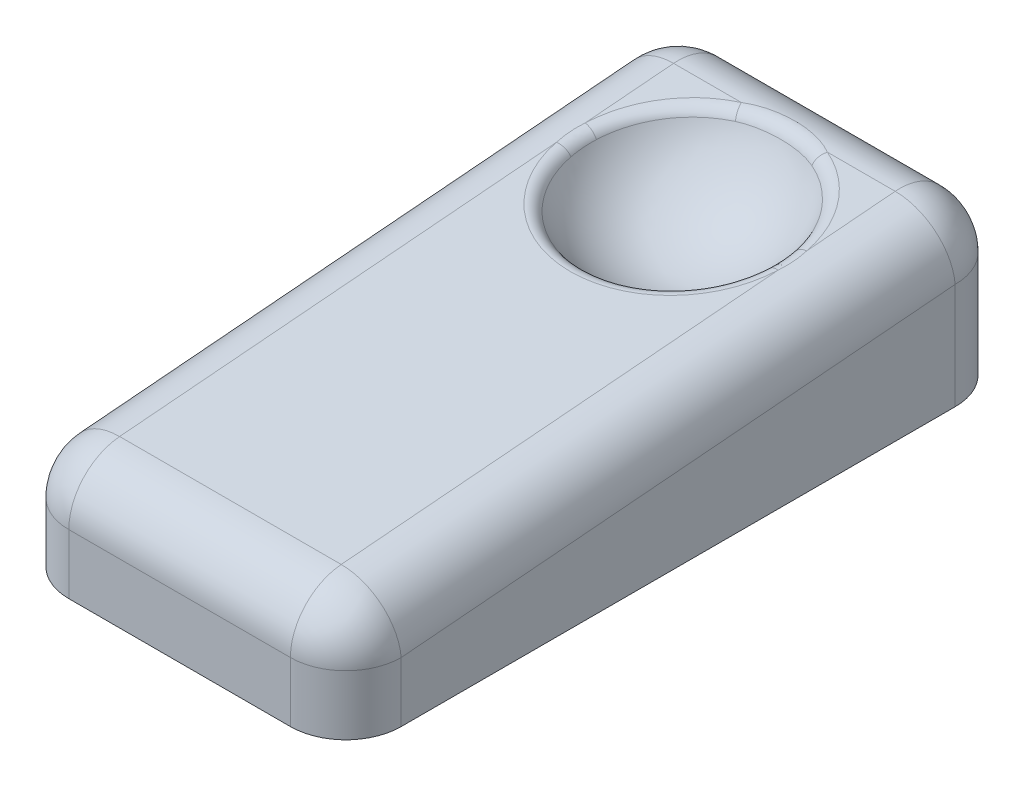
ISO-10303-21;
HEADER;
FILE_DESCRIPTION(('STEP AP214'),'2;1');
FILE_NAME('part.step','',(''),(''),'','','');
FILE_SCHEMA(('AUTOMOTIVE_DESIGN { 1 0 10303 214 1 1 1 1 }'));
ENDSEC;
DATA;
#1=APPLICATION_CONTEXT('core data for automotive mechanical design processes');
#2=APPLICATION_PROTOCOL_DEFINITION('international standard','automotive_design',2000,#1);
#3=PRODUCT_CONTEXT('',#1,'mechanical');
#4=PRODUCT('Part','Part','',(#3));
#5=PRODUCT_RELATED_PRODUCT_CATEGORY('part','',(#4));
#6=PRODUCT_DEFINITION_FORMATION('','',#4);
#7=PRODUCT_DEFINITION_CONTEXT('part definition',#1,'design');
#8=PRODUCT_DEFINITION('design','',#6,#7);
#9=PRODUCT_DEFINITION_SHAPE('','',#8);
#10=(LENGTH_UNIT() NAMED_UNIT(*) SI_UNIT(.MILLI.,.METRE.));
#11=(NAMED_UNIT(*) PLANE_ANGLE_UNIT() SI_UNIT($,.RADIAN.));
#12=(NAMED_UNIT(*) SI_UNIT($,.STERADIAN.) SOLID_ANGLE_UNIT());
#13=UNCERTAINTY_MEASURE_WITH_UNIT(LENGTH_MEASURE(1.E-05),#10,'distance_accuracy_value','');
#14=(GEOMETRIC_REPRESENTATION_CONTEXT(3) GLOBAL_UNCERTAINTY_ASSIGNED_CONTEXT((#13)) GLOBAL_UNIT_ASSIGNED_CONTEXT((#10,
#11,#12)) REPRESENTATION_CONTEXT('',''));
#15=CARTESIAN_POINT('',(0.,0.,0.));
#16=DIRECTION('',(0.,0.,1.));
#17=DIRECTION('',(1.,0.,0.));
#18=AXIS2_PLACEMENT_3D('',#15,#16,#17);
#19=CARTESIAN_POINT('',(-76.2,76.2,-76.2));
#20=DIRECTION('',(0.,-0.99654575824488,-0.08304547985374));
#21=DIRECTION('',(0.,0.08304547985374,-0.99654575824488));
#22=AXIS2_PLACEMENT_3D('',#19,#20,#21);
#23=PLANE('',#22);
#24=DIRECTION('',(0.,0.08304547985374,-0.99654575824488));
#25=VECTOR('',#24,1.);
#26=CARTESIAN_POINT('',(50.8,76.2,-76.2));
#27=LINE('',#26,#25);
#28=CARTESIAN_POINT('',(50.8,52.7408870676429,205.309355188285));
#29=VERTEX_POINT('',#28);
#30=CARTESIAN_POINT('',(50.8,69.4326442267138,5.00826927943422));
#31=VERTEX_POINT('',#30);
#32=EDGE_CURVE('E217',#29,#31,#27,.T.);
#33=ORIENTED_EDGE('',*,*,#32,.T.);
#34=CARTESIAN_POINT('',(0.,69.9813793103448,-1.57655172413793));
#35=DIRECTION('',(0.,-0.99654575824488,-0.08304547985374));
#36=DIRECTION('',(0.,0.08304547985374,-0.99654575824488));
#37=AXIS2_PLACEMENT_3D('',#34,#35,#36);
#38=CIRCLE('',#37,51.2279316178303);
#39=CARTESIAN_POINT('',(-50.8,69.4326442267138,5.00826927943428));
#40=VERTEX_POINT('',#39);
#41=EDGE_CURVE('E407',#31,#40,#38,.T.);
#42=ORIENTED_EDGE('',*,*,#41,.T.);
#43=DIRECTION('',(0.,0.08304547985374,-0.99654575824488));
#44=VECTOR('',#43,1.);
#45=CARTESIAN_POINT('',(-50.8,76.2,-76.2));
#46=LINE('',#45,#44);
#47=CARTESIAN_POINT('',(-50.8,52.7408870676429,205.309355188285));
#48=VERTEX_POINT('',#47);
#49=EDGE_CURVE('E208',#40,#48,#46,.F.);
#50=ORIENTED_EDGE('',*,*,#49,.T.);
#51=DIRECTION('',(1.,0.,0.));
#52=VECTOR('',#51,1.);
#53=CARTESIAN_POINT('',(-76.2,52.7408870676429,205.309355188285));
#54=LINE('',#53,#52);
#55=EDGE_CURVE('E220',#48,#29,#54,.T.);
#56=ORIENTED_EDGE('',*,*,#55,.T.);
#57=EDGE_LOOP('',(#33,#42,#50,#56));
#58=FACE_BOUND('',#57,.T.);
#59=ADVANCED_FACE('F39',(#58),#23,.F.);
#60=CARTESIAN_POINT('',(-50.8,73.9075537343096,-48.690644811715));
#61=VERTEX_POINT('',#60);
#62=CARTESIAN_POINT('',(-50.8,70.5301143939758,-8.16137272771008));
#63=VERTEX_POINT('',#62);
#64=EDGE_CURVE('E209',#61,#63,#46,.F.);
#65=ORIENTED_EDGE('',*,*,#64,.T.);
#66=CARTESIAN_POINT('',(0.,69.9813793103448,-1.57655172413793));
#67=DIRECTION('',(0.,-0.99654575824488,-0.08304547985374));
#68=DIRECTION('',(0.,0.08304547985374,-0.99654575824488));
#69=AXIS2_PLACEMENT_3D('',#66,#67,#68);
#70=CIRCLE('',#69,51.2279316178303);
#71=CARTESIAN_POINT('',(-19.7268437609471,73.9075537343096,-48.690644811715));
#72=VERTEX_POINT('',#71);
#73=EDGE_CURVE('E406',#63,#72,#70,.T.);
#74=ORIENTED_EDGE('',*,*,#73,.T.);
#75=DIRECTION('',(-1.,0.,0.));
#76=VECTOR('',#75,1.);
#77=CARTESIAN_POINT('',(-76.2,73.9075537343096,-48.690644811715));
#78=LINE('',#77,#76);
#79=EDGE_CURVE('E212',#72,#61,#78,.T.);
#80=ORIENTED_EDGE('',*,*,#79,.T.);
#81=EDGE_LOOP('',(#65,#74,#80));
#82=FACE_BOUND('',#81,.T.);
#83=ADVANCED_FACE('F459',(#82),#23,.F.);
#84=CARTESIAN_POINT('',(-76.2,76.2,-76.2));
#85=DIRECTION('',(1.,0.,0.));
#86=DIRECTION('',(0.,0.,-1.));
#87=AXIS2_PLACEMENT_3D('',#84,#85,#86);
#88=PLANE('',#87);
#89=DIRECTION('',(0.,-1.,0.));
#90=VECTOR('',#89,1.);
#91=CARTESIAN_POINT('',(-76.2,76.2,203.2));
#92=LINE('',#91,#90);
#93=CARTESIAN_POINT('',(-76.2,0.,203.2));
#94=VERTEX_POINT('',#93);
#95=CARTESIAN_POINT('',(-76.2,27.428624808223,203.2));
#96=VERTEX_POINT('',#95);
#97=EDGE_CURVE('E195',#94,#96,#92,.F.);
#98=ORIENTED_EDGE('',*,*,#97,.T.);
#99=DIRECTION('',(0.,0.08304547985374,-0.99654575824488));
#100=VECTOR('',#99,1.);
#101=CARTESIAN_POINT('',(-76.2,50.8877377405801,-78.309355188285));
#102=LINE('',#101,#100);
#103=CARTESIAN_POINT('',(-76.2,48.5952914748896,-50.8));
#104=VERTEX_POINT('',#103);
#105=EDGE_CURVE('E234',#96,#104,#102,.T.);
#106=ORIENTED_EDGE('',*,*,#105,.T.);
#107=DIRECTION('',(0.,-1.,0.));
#108=VECTOR('',#107,1.);
#109=CARTESIAN_POINT('',(-76.2,76.2,-50.8));
#110=LINE('',#109,#108);
#111=CARTESIAN_POINT('',(-76.2,0.,-50.8));
#112=VERTEX_POINT('',#111);
#113=EDGE_CURVE('E198',#104,#112,#110,.T.);
#114=ORIENTED_EDGE('',*,*,#113,.T.);
#115=DIRECTION('',(0.,0.,1.));
#116=VECTOR('',#115,1.);
#117=CARTESIAN_POINT('',(-76.2,0.,-76.2));
#118=LINE('',#117,#116);
#119=EDGE_CURVE('E260',#112,#94,#118,.T.);
#120=ORIENTED_EDGE('',*,*,#119,.T.);
#121=EDGE_LOOP('',(#98,#106,#114,#120));
#122=FACE_BOUND('',#121,.T.);
#123=ADVANCED_FACE('F433',(#122),#88,.F.);
#124=CARTESIAN_POINT('',(-76.2,76.2,228.6));
#125=DIRECTION('',(0.,0.,-1.));
#126=DIRECTION('',(-1.,0.,0.));
#127=AXIS2_PLACEMENT_3D('',#124,#125,#126);
#128=PLANE('',#127);
#129=DIRECTION('',(0.,-1.,0.));
#130=VECTOR('',#129,1.);
#131=CARTESIAN_POINT('',(50.8,76.2,228.6));
#132=LINE('',#131,#130);
#133=CARTESIAN_POINT('',(50.8,0.,228.6));
#134=VERTEX_POINT('',#133);
#135=CARTESIAN_POINT('',(50.8,27.428624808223,228.6));
#136=VERTEX_POINT('',#135);
#137=EDGE_CURVE('E200',#134,#136,#132,.F.);
#138=ORIENTED_EDGE('',*,*,#137,.T.);
#139=DIRECTION('',(1.,0.,0.));
#140=VECTOR('',#139,1.);
#141=CARTESIAN_POINT('',(-76.2,27.428624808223,228.6));
#142=LINE('',#141,#140);
#143=CARTESIAN_POINT('',(-50.8,27.428624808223,228.6));
#144=VERTEX_POINT('',#143);
#145=EDGE_CURVE('E223',#136,#144,#142,.F.);
#146=ORIENTED_EDGE('',*,*,#145,.T.);
#147=DIRECTION('',(0.,-1.,0.));
#148=VECTOR('',#147,1.);
#149=CARTESIAN_POINT('',(-50.8,76.2,228.6));
#150=LINE('',#149,#148);
#151=CARTESIAN_POINT('',(-50.8,0.,228.6));
#152=VERTEX_POINT('',#151);
#153=EDGE_CURVE('E203',#144,#152,#150,.T.);
#154=ORIENTED_EDGE('',*,*,#153,.T.);
#155=DIRECTION('',(1.,0.,0.));
#156=VECTOR('',#155,1.);
#157=CARTESIAN_POINT('',(-76.2,0.,228.6));
#158=LINE('',#157,#156);
#159=EDGE_CURVE('E185',#152,#134,#158,.T.);
#160=ORIENTED_EDGE('',*,*,#159,.T.);
#161=EDGE_LOOP('',(#138,#146,#154,#160));
#162=FACE_BOUND('',#161,.T.);
#163=ADVANCED_FACE('F440',(#162),#128,.F.);
#164=CARTESIAN_POINT('',(76.2,76.2,-76.2));
#165=DIRECTION('',(-1.,0.,0.));
#166=DIRECTION('',(0.,0.,1.));
#167=AXIS2_PLACEMENT_3D('',#164,#165,#166);
#168=PLANE('',#167);
#169=DIRECTION('',(0.,-1.,0.));
#170=VECTOR('',#169,1.);
#171=CARTESIAN_POINT('',(76.2,76.2,-50.8));
#172=LINE('',#171,#170);
#173=CARTESIAN_POINT('',(76.2,0.,-50.8));
#174=VERTEX_POINT('',#173);
#175=CARTESIAN_POINT('',(76.2,48.5952914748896,-50.8));
#176=VERTEX_POINT('',#175);
#177=EDGE_CURVE('E172',#174,#176,#172,.F.);
#178=ORIENTED_EDGE('',*,*,#177,.T.);
#179=DIRECTION('',(0.,0.08304547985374,-0.99654575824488));
#180=VECTOR('',#179,1.);
#181=CARTESIAN_POINT('',(76.2,50.8877377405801,-78.309355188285));
#182=LINE('',#181,#180);
#183=CARTESIAN_POINT('',(76.2,27.428624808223,203.2));
#184=VERTEX_POINT('',#183);
#185=EDGE_CURVE('E227',#176,#184,#182,.F.);
#186=ORIENTED_EDGE('',*,*,#185,.T.);
#187=DIRECTION('',(0.,-1.,0.));
#188=VECTOR('',#187,1.);
#189=CARTESIAN_POINT('',(76.2,76.2,203.2));
#190=LINE('',#189,#188);
#191=CARTESIAN_POINT('',(76.2,0.,203.2));
#192=VERTEX_POINT('',#191);
#193=EDGE_CURVE('E176',#184,#192,#190,.T.);
#194=ORIENTED_EDGE('',*,*,#193,.T.);
#195=DIRECTION('',(0.,0.,-1.));
#196=VECTOR('',#195,1.);
#197=CARTESIAN_POINT('',(76.2,0.,-76.2));
#198=LINE('',#197,#196);
#199=EDGE_CURVE('E182',#192,#174,#198,.T.);
#200=ORIENTED_EDGE('',*,*,#199,.T.);
#201=EDGE_LOOP('',(#178,#186,#194,#200));
#202=FACE_BOUND('',#201,.T.);
#203=ADVANCED_FACE('F452',(#202),#168,.F.);
#204=CARTESIAN_POINT('',(-76.2,76.2,-76.2));
#205=DIRECTION('',(0.,0.,1.));
#206=DIRECTION('',(1.,0.,0.));
#207=AXIS2_PLACEMENT_3D('',#204,#205,#206);
#208=PLANE('',#207);
#209=DIRECTION('',(0.,-1.,0.));
#210=VECTOR('',#209,1.);
#211=CARTESIAN_POINT('',(-50.8,76.2,-76.2));
#212=LINE('',#211,#210);
#213=CARTESIAN_POINT('',(-50.8,0.,-76.2));
#214=VERTEX_POINT('',#213);
#215=CARTESIAN_POINT('',(-50.8,48.5952914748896,-76.2));
#216=VERTEX_POINT('',#215);
#217=EDGE_CURVE('E166',#214,#216,#212,.F.);
#218=ORIENTED_EDGE('',*,*,#217,.T.);
#219=DIRECTION('',(-1.,0.,0.));
#220=VECTOR('',#219,1.);
#221=CARTESIAN_POINT('',(-76.2,48.5952914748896,-76.2));
#222=LINE('',#221,#220);
#223=CARTESIAN_POINT('',(50.8,48.5952914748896,-76.2));
#224=VERTEX_POINT('',#223);
#225=EDGE_CURVE('E162',#216,#224,#222,.F.);
#226=ORIENTED_EDGE('',*,*,#225,.T.);
#227=DIRECTION('',(0.,-1.,0.));
#228=VECTOR('',#227,1.);
#229=CARTESIAN_POINT('',(50.8,76.2,-76.2));
#230=LINE('',#229,#228);
#231=CARTESIAN_POINT('',(50.7999999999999,0.,-76.2));
#232=VERTEX_POINT('',#231);
#233=EDGE_CURVE('E154',#224,#232,#230,.T.);
#234=ORIENTED_EDGE('',*,*,#233,.T.);
#235=DIRECTION('',(-1.,0.,0.));
#236=VECTOR('',#235,1.);
#237=CARTESIAN_POINT('',(-76.2,0.,-76.2));
#238=LINE('',#237,#236);
#239=EDGE_CURVE('E159',#232,#214,#238,.T.);
#240=ORIENTED_EDGE('',*,*,#239,.T.);
#241=EDGE_LOOP('',(#218,#226,#234,#240));
#242=FACE_BOUND('',#241,.T.);
#243=ADVANCED_FACE('F157',(#242),#208,.F.);
#244=CARTESIAN_POINT('',(-76.2,0.,228.6));
#245=DIRECTION('',(0.,1.,0.));
#246=DIRECTION('',(0.,0.,1.));
#247=AXIS2_PLACEMENT_3D('',#244,#245,#246);
#248=PLANE('',#247);
#249=ORIENTED_EDGE('',*,*,#239,.F.);
#250=CARTESIAN_POINT('',(50.8,0.,-50.8));
#251=DIRECTION('',(0.,1.,0.));
#252=DIRECTION('',(0.,0.,1.));
#253=AXIS2_PLACEMENT_3D('',#250,#251,#252);
#254=CIRCLE('',#253,25.4);
#255=EDGE_CURVE('E169',#232,#174,#254,.F.);
#256=ORIENTED_EDGE('',*,*,#255,.T.);
#257=ORIENTED_EDGE('',*,*,#199,.F.);
#258=CARTESIAN_POINT('',(50.8,0.,203.2));
#259=DIRECTION('',(0.,1.,0.));
#260=DIRECTION('',(0.,0.,1.));
#261=AXIS2_PLACEMENT_3D('',#258,#259,#260);
#262=CIRCLE('',#261,25.4);
#263=EDGE_CURVE('E165',#192,#134,#262,.F.);
#264=ORIENTED_EDGE('',*,*,#263,.T.);
#265=ORIENTED_EDGE('',*,*,#159,.F.);
#266=CARTESIAN_POINT('',(-50.8,0.,203.2));
#267=DIRECTION('',(0.,1.,0.));
#268=DIRECTION('',(0.,0.,1.));
#269=AXIS2_PLACEMENT_3D('',#266,#267,#268);
#270=CIRCLE('',#269,25.4);
#271=EDGE_CURVE('E190',#152,#94,#270,.F.);
#272=ORIENTED_EDGE('',*,*,#271,.T.);
#273=ORIENTED_EDGE('',*,*,#119,.F.);
#274=CARTESIAN_POINT('',(-50.8,0.,-50.8));
#275=DIRECTION('',(0.,1.,0.));
#276=DIRECTION('',(0.,0.,1.));
#277=AXIS2_PLACEMENT_3D('',#274,#275,#276);
#278=CIRCLE('',#277,25.4);
#279=EDGE_CURVE('E177',#112,#214,#278,.F.);
#280=ORIENTED_EDGE('',*,*,#279,.T.);
#281=EDGE_LOOP('',(#249,#256,#257,#264,#265,#272,#273,#280));
#282=FACE_BOUND('',#281,.T.);
#283=ADVANCED_FACE('F179',(#282),#248,.F.);
#284=CARTESIAN_POINT('',(50.8,73.9075537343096,-48.690644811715));
#285=VERTEX_POINT('',#284);
#286=CARTESIAN_POINT('',(19.7268437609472,73.9075537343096,-48.690644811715));
#287=VERTEX_POINT('',#286);
#288=EDGE_CURVE('E213',#285,#287,#78,.T.);
#289=ORIENTED_EDGE('',*,*,#288,.T.);
#290=CARTESIAN_POINT('',(0.,69.9813793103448,-1.57655172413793));
#291=DIRECTION('',(0.,-0.99654575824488,-0.08304547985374));
#292=DIRECTION('',(0.,0.08304547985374,-0.99654575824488));
#293=AXIS2_PLACEMENT_3D('',#290,#291,#292);
#294=CIRCLE('',#293,51.2279316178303);
#295=CARTESIAN_POINT('',(50.8,70.5301143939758,-8.16137272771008));
#296=VERTEX_POINT('',#295);
#297=EDGE_CURVE('E268',#287,#296,#294,.T.);
#298=ORIENTED_EDGE('',*,*,#297,.T.);
#299=EDGE_CURVE('E216',#296,#285,#27,.T.);
#300=ORIENTED_EDGE('',*,*,#299,.T.);
#301=EDGE_LOOP('',(#289,#298,#300));
#302=FACE_BOUND('',#301,.T.);
#303=ADVANCED_FACE('F457',(#302),#23,.F.);
#304=CARTESIAN_POINT('',(0.,88.9,0.));
#305=DIRECTION('',(-1.,0.,0.));
#306=DIRECTION('',(0.,0.,-1.));
#307=AXIS2_PLACEMENT_3D('',#304,#305,#306);
#308=SPHERICAL_SURFACE('',#307,50.8);
#309=CARTESIAN_POINT('',(44.7458578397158,67.1538404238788,-10.2738867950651));
#310=CARTESIAN_POINT('',(46.4151666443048,70.6110826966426,-10.321297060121));
#311=CARTESIAN_POINT('',(50.1854534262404,70.7617835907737,-11.0309382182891));
#312=CARTESIAN_POINT('',(44.8267718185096,67.1205563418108,-9.85102827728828));
#313=CARTESIAN_POINT('',(46.5089944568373,70.5944838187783,-9.87748162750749));
#314=CARTESIAN_POINT('',(50.306824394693,70.7250667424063,-10.5551617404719));
#315=CARTESIAN_POINT('',(44.9013009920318,67.0864658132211,-9.42705065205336));
#316=CARTESIAN_POINT('',(46.5952218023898,70.5757913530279,-9.43378282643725));
#317=CARTESIAN_POINT('',(50.4186181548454,70.6871770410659,-10.0781484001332));
#318=CARTESIAN_POINT('',(45.0378230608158,67.017115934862,-8.57675441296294));
#319=CARTESIAN_POINT('',(46.7531681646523,70.5345797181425,-8.54476133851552));
#320=CARTESIAN_POINT('',(50.6234012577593,70.6097200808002,-9.12151832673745));
#321=CARTESIAN_POINT('',(45.0998038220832,66.9818554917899,-8.15043393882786));
#322=CARTESIAN_POINT('',(46.8248042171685,70.5120561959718,-8.0996211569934));
#323=CARTESIAN_POINT('',(50.716372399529,70.570151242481,-8.6418995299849));
#324=CARTESIAN_POINT('',(45.2820812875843,66.8654962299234,-6.7539383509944));
#325=CARTESIAN_POINT('',(47.0357965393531,70.4327993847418,-6.6407805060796));
#326=CARTESIAN_POINT('',(50.9897885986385,70.439252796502,-7.07084151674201));
#327=CARTESIAN_POINT('',(45.3765250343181,66.7830301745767,-5.78038343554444));
#328=CARTESIAN_POINT('',(47.1445978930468,70.3692009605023,-5.6285340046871));
#329=CARTESIAN_POINT('',(51.131454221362,70.3459807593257,-5.97563371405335));
#330=CARTESIAN_POINT('',(45.5023883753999,66.6182902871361,-3.82900535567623));
#331=CARTESIAN_POINT('',(47.2899063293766,70.2276413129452,-3.60033514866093));
#332=CARTESIAN_POINT('',(51.3202492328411,70.1598569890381,-3.78039932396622));
#333=CARTESIAN_POINT('',(45.5337890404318,66.5360165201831,-2.85118099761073));
#334=CARTESIAN_POINT('',(47.3260519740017,70.1498072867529,-2.58674123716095));
#335=CARTESIAN_POINT('',(51.367350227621,70.067005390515,-2.68037138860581));
#336=CARTESIAN_POINT('',(45.5339088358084,66.3729738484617,-0.894704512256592));
#337=CARTESIAN_POINT('',(47.3261900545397,69.9807317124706,-0.557530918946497));
#338=CARTESIAN_POINT('',(51.3675299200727,69.8835812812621,-0.479335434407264));
#339=CARTESIAN_POINT('',(45.5025838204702,66.2922060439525,0.0839477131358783));
#340=CARTESIAN_POINT('',(47.2901313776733,69.8896807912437,0.45568542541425));
#341=CARTESIAN_POINT('',(51.3205423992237,69.7930104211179,0.621672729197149));
#342=CARTESIAN_POINT('',(45.3767551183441,66.1315335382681,2.03754810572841));
#343=CARTESIAN_POINT('',(47.144864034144,69.693435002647,2.48127727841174));
#344=CARTESIAN_POINT('',(51.1317993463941,69.6130461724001,2.81953919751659));
#345=CARTESIAN_POINT('',(45.282238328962,66.0516290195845,3.01249546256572));
#346=CARTESIAN_POINT('',(47.0359803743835,69.5884985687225,3.491298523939));
#347=CARTESIAN_POINT('',(50.9900241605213,69.5236530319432,3.9163965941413));
#348=CARTESIAN_POINT('',(45.0818368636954,65.9236640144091,4.54782982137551));
#349=CARTESIAN_POINT('',(46.8040816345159,69.409017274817,5.08696086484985));
#350=CARTESIAN_POINT('',(50.6894219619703,69.3796847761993,5.64364711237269));
#351=CARTESIAN_POINT('',(44.997225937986,65.8762569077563,5.11112257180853));
#352=CARTESIAN_POINT('',(46.7063116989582,69.3402960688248,5.67199494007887));
#353=CARTESIAN_POINT('',(50.5625055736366,69.3261782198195,6.27733699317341));
#354=CARTESIAN_POINT('',(44.8058400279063,65.7798214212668,6.233825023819));
#355=CARTESIAN_POINT('',(46.4848313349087,69.1962961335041,6.8394793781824));
#356=CARTESIAN_POINT('',(50.2754267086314,69.2166168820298,7.5402879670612));
#357=CARTESIAN_POINT('',(44.6990649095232,65.7307930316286,6.79323470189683));
#358=CARTESIAN_POINT('',(46.3612882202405,69.1210912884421,7.42151945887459));
#359=CARTESIAN_POINT('',(50.1152640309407,69.160562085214,8.16954903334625));
#360=CARTESIAN_POINT('',(44.4629657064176,65.6299587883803,7.90671512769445));
#361=CARTESIAN_POINT('',(46.0876842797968,68.9630347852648,8.58170240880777));
#362=CARTESIAN_POINT('',(49.761115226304,69.0441277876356,9.42196486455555));
#363=CARTESIAN_POINT('',(44.3336536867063,65.5781544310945,8.46078856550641));
#364=CARTESIAN_POINT('',(45.9378385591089,68.8802721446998,9.15946762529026));
#365=CARTESIAN_POINT('',(49.5671471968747,68.9837506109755,10.0451227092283));
#366=CARTESIAN_POINT('',(44.0518927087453,65.4702365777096,9.56259194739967));
#367=CARTESIAN_POINT('',(45.6107901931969,68.7055920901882,10.3101804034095));
#368=CARTESIAN_POINT('',(49.1445057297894,68.8563468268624,11.2841518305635));
#369=CARTESIAN_POINT('',(43.8994446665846,65.414123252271,10.1103221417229));
#370=CARTESIAN_POINT('',(45.4338197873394,68.6137729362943,10.8827883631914));
#371=CARTESIAN_POINT('',(48.9158336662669,68.7893204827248,11.9000233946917));
#372=CARTESIAN_POINT('',(43.5702538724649,65.2955437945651,11.1995906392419));
#373=CARTESIAN_POINT('',(45.0510034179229,68.4188180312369,12.023402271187));
#374=CARTESIAN_POINT('',(48.4220474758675,68.6455628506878,13.1245874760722));
#375=CARTESIAN_POINT('',(43.3934391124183,65.233058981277,11.7411052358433));
#376=CARTESIAN_POINT('',(44.845328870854,68.3157619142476,12.5911024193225));
#377=CARTESIAN_POINT('',(48.1568253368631,68.5688028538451,13.7332526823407));
#378=CARTESIAN_POINT('',(43.0151445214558,65.0995912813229,12.8142889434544));
#379=CARTESIAN_POINT('',(44.4044636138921,68.0962208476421,13.7180803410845));
#380=CARTESIAN_POINT('',(47.5893834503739,68.402252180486,14.9392177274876));
#381=CARTESIAN_POINT('',(42.8136695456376,65.0286100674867,13.3459599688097));
#382=CARTESIAN_POINT('',(44.1695618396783,67.9798722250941,14.2771187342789));
#383=CARTESIAN_POINT('',(47.2871709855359,68.3124640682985,15.5365197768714));
#384=CARTESIAN_POINT('',(42.384636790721,64.8751536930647,14.3985737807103));
#385=CARTESIAN_POINT('',(43.6683607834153,67.7304891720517,15.3857507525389));
#386=CARTESIAN_POINT('',(46.6436218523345,68.1153437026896,16.7186701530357));
#387=CARTESIAN_POINT('',(42.1570184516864,64.7926517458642,14.9194882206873));
#388=CARTESIAN_POINT('',(43.4022861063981,67.5975705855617,15.935150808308));
#389=CARTESIAN_POINT('',(46.30219434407,68.0079704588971,17.3034856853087));
#390=CARTESIAN_POINT('',(41.7955786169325,64.657772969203,15.6896972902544));
#391=CARTESIAN_POINT('',(42.9781973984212,67.3826917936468,16.7500810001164));
#392=CARTESIAN_POINT('',(45.7600345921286,67.8299041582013,18.1677769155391));
#393=CARTESIAN_POINT('',(41.6717125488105,64.6109392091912,15.9446677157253));
#394=CARTESIAN_POINT('',(42.8330173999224,67.3086611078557,17.019610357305));
#395=CARTESIAN_POINT('',(45.5742354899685,67.7676875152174,18.4538245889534));
#396=CARTESIAN_POINT('',(41.4171796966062,64.5130398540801,16.4504086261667));
#397=CARTESIAN_POINT('',(42.5344093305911,67.1549997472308,17.5546106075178));
#398=CARTESIAN_POINT('',(45.1924362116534,67.6367870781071,19.0210528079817));
#399=CARTESIAN_POINT('',(41.2865119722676,64.4619736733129,16.7011785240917));
#400=CARTESIAN_POINT('',(42.3810185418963,67.0753925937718,17.8200749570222));
#401=CARTESIAN_POINT('',(44.9964346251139,67.5681023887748,19.3022326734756));
#402=CARTESIAN_POINT('',(41.1523853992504,64.4085331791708,16.9496085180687));
#403=CARTESIAN_POINT('',(42.2231468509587,66.9925678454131,18.0837002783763));
#404=CARTESIAN_POINT('',(44.7952447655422,67.495789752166,19.5807004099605));
#405=(BOUNDED_SURFACE() B_SPLINE_SURFACE(3,2,((#309,#310,#311),(#312,#313,#314),(#315,#316,
#317),(#318,#319,#320),(#321,#322,#323),(#324,#325,#326),(#327,#328,#329),(#330,#331,#332),
(#333,#334,#335),(#336,#337,#338),(#339,#340,#341),(#342,#343,#344),(#345,#346,#347),(#348,#349,
#350),(#351,#352,#353),(#354,#355,#356),(#357,#358,#359),(#360,#361,#362),(#363,#364,#365),
(#366,#367,#368),(#369,#370,#371),(#372,#373,#374),(#375,#376,#377),(#378,#379,#380),(#381,#382,
#383),(#384,#385,#386),(#387,#388,#389),(#390,#391,#392),(#393,#394,#395),(#396,#397,#398),
(#399,#400,#401),(#402,#403,#404)),.UNSPECIFIED.,.F.,.F.,.F.) B_SPLINE_SURFACE_WITH_KNOTS((4,2,
2,2,2,2,2,2,2,2,2,2,2,2,2,4),(3,3),(0.,1.45723911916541,2.91588069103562,6.22619377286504,
9.53750066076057,12.8511388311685,16.1654642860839,18.0941222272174,20.0227918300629,
21.9504320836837,23.8779960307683,25.8113835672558,27.7443910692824,29.6819702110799,
30.6514948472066,31.6211538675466),(0.,1.),
.UNSPECIFIED.) GEOMETRIC_REPRESENTATION_ITEM() RATIONAL_B_SPLINE_SURFACE(((1.,0.855737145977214,
1.),(1.,0.854522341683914,1.),(1.,0.853393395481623,1.),(1.,0.851311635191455,1.),(1.,
0.850358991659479,1.),(1.,0.847543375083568,1.),(1.,0.846059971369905,1.),(1.,0.844076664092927,
1.),(1.,0.843577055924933,1.),(1.,0.843575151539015,1.),(1.,0.844073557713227,1.),(1.,
0.846056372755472,1.),(1.,0.847540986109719,1.),(1.,0.850636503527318,1.),(1.,0.851935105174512,
1.),(1.,0.854839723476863,1.),(1.,0.85644574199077,1.),(1.,0.859949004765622,1.),(1.,
0.861846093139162,1.),(1.,0.865913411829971,1.),(1.,0.868083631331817,1.),(1.,0.872682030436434,
1.),(1.,0.875110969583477,1.),(1.,0.880194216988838,1.),(1.,0.882848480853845,1.),(1.,
0.888357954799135,1.),(1.,0.891213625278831,1.),(1.,0.895615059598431,1.),(1.,0.897102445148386,
1.),(1.,0.900110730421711,1.),(1.,0.901631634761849,1.),(1.,0.90316634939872,1.))) REPRESENTATION_ITEM('') SURFACE());
#406=CARTESIAN_POINT('',(41.1523853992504,64.4085331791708,16.9496085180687));
#407=CARTESIAN_POINT('',(41.2865119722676,64.4619736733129,16.7011785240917));
#408=CARTESIAN_POINT('',(41.4171796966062,64.5130398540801,16.4504086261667));
#409=CARTESIAN_POINT('',(41.6717125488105,64.6109392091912,15.9446677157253));
#410=CARTESIAN_POINT('',(41.7955786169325,64.657772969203,15.6896972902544));
#411=CARTESIAN_POINT('',(42.1570184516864,64.7926517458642,14.9194882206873));
#412=CARTESIAN_POINT('',(42.384636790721,64.8751536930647,14.3985737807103));
#413=CARTESIAN_POINT('',(42.8136695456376,65.0286100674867,13.3459599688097));
#414=CARTESIAN_POINT('',(43.0151445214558,65.0995912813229,12.8142889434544));
#415=CARTESIAN_POINT('',(43.3934391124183,65.233058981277,11.7411052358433));
#416=CARTESIAN_POINT('',(43.5702538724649,65.295543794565,11.1995906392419));
#417=CARTESIAN_POINT('',(43.8994446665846,65.414123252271,10.1103221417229));
#418=CARTESIAN_POINT('',(44.0518927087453,65.4702365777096,9.56259194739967));
#419=CARTESIAN_POINT('',(44.3336536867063,65.5781544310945,8.4607885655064));
#420=CARTESIAN_POINT('',(44.4629657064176,65.6299587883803,7.90671512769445));
#421=CARTESIAN_POINT('',(44.6990649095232,65.7307930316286,6.79323470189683));
#422=CARTESIAN_POINT('',(44.8058400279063,65.7798214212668,6.233825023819));
#423=CARTESIAN_POINT('',(44.997225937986,65.8762569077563,5.11112257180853));
#424=CARTESIAN_POINT('',(45.0818368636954,65.9236640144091,4.54782982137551));
#425=CARTESIAN_POINT('',(45.282238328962,66.0516290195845,3.01249546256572));
#426=CARTESIAN_POINT('',(45.3767551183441,66.1315335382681,2.03754810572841));
#427=CARTESIAN_POINT('',(45.5025838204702,66.2922060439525,0.0839477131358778));
#428=CARTESIAN_POINT('',(45.5339088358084,66.3729738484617,-0.894704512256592));
#429=CARTESIAN_POINT('',(45.5337890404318,66.5360165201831,-2.85118099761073));
#430=CARTESIAN_POINT('',(45.5023883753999,66.6182902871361,-3.82900535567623));
#431=CARTESIAN_POINT('',(45.3765250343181,66.7830301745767,-5.78038343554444));
#432=CARTESIAN_POINT('',(45.2820812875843,66.8654962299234,-6.7539383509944));
#433=CARTESIAN_POINT('',(45.0998038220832,66.9818554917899,-8.15043393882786));
#434=CARTESIAN_POINT('',(45.0378230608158,67.017115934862,-8.57675441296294));
#435=CARTESIAN_POINT('',(44.9013009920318,67.0864658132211,-9.42705065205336));
#436=CARTESIAN_POINT('',(44.8267718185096,67.1205563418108,-9.85102827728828));
#437=CARTESIAN_POINT('',(44.7458578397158,67.1538404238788,-10.2738867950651));
#438=B_SPLINE_CURVE_WITH_KNOTS('',3,(#406,#407,#408,#409,#410,#411,#412,#413,#414,#415,#416,
#417,#418,#419,#420,#421,#422,#423,#424,#425,#426,#427,#428,#429,#430,#431,#432,#433,#434,#435,
#436,#437),.UNSPECIFIED.,.F.,.F.,(4,2,2,2,2,2,2,2,2,2,2,2,2,2,2,4),(0.,0.969659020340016,
1.93918365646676,3.87676279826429,5.80977030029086,7.74315783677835,9.67072178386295,
11.5983620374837,13.5270316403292,15.4556895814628,18.7700150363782,22.0836532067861,
25.3949600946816,28.705273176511,30.1639147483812,31.6211538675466),.UNSPECIFIED.);
#439=CARTESIAN_POINT('',(45.1555555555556,65.970736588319,3.98304931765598));
#440=VERTEX_POINT('',#439);
#441=CARTESIAN_POINT('',(45.1555555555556,66.9462656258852,-7.72329913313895));
#442=VERTEX_POINT('',#441);
#443=EDGE_CURVE('E358',#440,#442,#438,.T.);
#444=ORIENTED_EDGE('',*,*,#443,.T.);
#445=CARTESIAN_POINT('',(0.,66.4585011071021,-1.87012490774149));
#446=DIRECTION('',(0.,0.99654575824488,0.08304547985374));
#447=DIRECTION('',(0.,-0.08304547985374,0.99654575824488));
#448=AXIS2_PLACEMENT_3D('',#445,#446,#447);
#449=CIRCLE('',#448,45.5359392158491);
#450=CARTESIAN_POINT('',(17.534972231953,69.9484339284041,-43.7493187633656));
#451=VERTEX_POINT('',#450);
#452=EDGE_CURVE('E11',#442,#451,#449,.T.);
#453=ORIENTED_EDGE('',*,*,#452,.T.);
#454=CARTESIAN_POINT('',(-24.9363758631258,69.0558380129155,-39.5604144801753));
#455=CARTESIAN_POINT('',(-26.1364291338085,71.7867697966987,-40.1738578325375));
#456=CARTESIAN_POINT('',(-28.0534228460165,72.5686598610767,-42.4072883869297));
#457=CARTESIAN_POINT('',(-24.6567707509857,69.1306431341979,-39.7741862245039));
#458=CARTESIAN_POINT('',(-25.8330338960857,71.9087045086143,-40.4262639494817));
#459=CARTESIAN_POINT('',(-27.7388670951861,72.6808675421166,-42.7279460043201));
#460=CARTESIAN_POINT('',(-24.3718813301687,69.1990165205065,-39.9831484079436));
#461=CARTESIAN_POINT('',(-25.5250206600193,72.0226999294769,-40.6719760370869));
#462=CARTESIAN_POINT('',(-27.4183664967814,72.7834276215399,-43.0413892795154));
#463=CARTESIAN_POINT('',(-23.7929271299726,69.324302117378,-40.3913097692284));
#464=CARTESIAN_POINT('',(-24.8998700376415,72.2370692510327,-41.151354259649));
#465=CARTESIAN_POINT('',(-26.7670430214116,72.9713560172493,-43.6536313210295));
#466=CARTESIAN_POINT('',(-23.4988665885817,69.3812195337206,-40.5905133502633));
#467=CARTESIAN_POINT('',(-24.5826832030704,72.3373826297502,-41.3849702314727));
#468=CARTESIAN_POINT('',(-26.4362249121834,73.0567321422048,-43.9524366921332));
#469=CARTESIAN_POINT('',(-22.903405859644,69.4849391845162,-40.9787524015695));
#470=CARTESIAN_POINT('',(-23.94125430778,72.5258052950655,-41.8397879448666));
#471=CARTESIAN_POINT('',(-25.7663315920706,73.2123116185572,-44.5347952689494));
#472=CARTESIAN_POINT('',(-22.6020245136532,69.5317648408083,-41.1678106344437));
#473=CARTESIAN_POINT('',(-23.6169934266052,72.6138808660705,-42.0609551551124));
#474=CARTESIAN_POINT('',(-25.4272775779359,73.2825501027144,-44.8183826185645));
#475=CARTESIAN_POINT('',(-21.9922187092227,69.6167066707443,-41.536317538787));
#476=CARTESIAN_POINT('',(-22.9617679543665,72.7794554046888,-42.4916355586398));
#477=CARTESIAN_POINT('',(-24.7412460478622,73.4099628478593,-45.3711429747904));
#478=CARTESIAN_POINT('',(-21.6837933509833,69.6548217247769,-41.7157649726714));
#479=CARTESIAN_POINT('',(-22.6307861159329,72.8568943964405,-42.7010758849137));
#480=CARTESIAN_POINT('',(-24.3942675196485,73.4671354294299,-45.6403141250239));
#481=CARTESIAN_POINT('',(-20.7539738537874,69.7572901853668,-42.2371422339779));
#482=CARTESIAN_POINT('',(-21.6318511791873,73.074643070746,-43.3105849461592));
#483=CARTESIAN_POINT('',(-23.34822058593,73.6208381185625,-46.4223800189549));
#484=CARTESIAN_POINT('',(-20.1234451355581,69.8105251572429,-42.565079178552));
#485=CARTESIAN_POINT('',(-20.9579273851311,73.2003873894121,-43.6918402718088));
#486=CARTESIAN_POINT('',(-22.6388757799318,73.7006905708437,-46.9142854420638));
#487=CARTESIAN_POINT('',(-18.8428313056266,69.8947124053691,-43.1844302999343));
#488=CARTESIAN_POINT('',(-19.5929464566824,73.4233165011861,-44.4111693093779));
#489=CARTESIAN_POINT('',(-21.1981852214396,73.8269714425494,-47.8433121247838));
#490=CARTESIAN_POINT('',(-18.1927304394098,69.9256462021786,-43.4758140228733));
#491=CARTESIAN_POINT('',(-18.9020836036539,73.5201339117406,-44.7485817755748));
#492=CARTESIAN_POINT('',(-20.4668217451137,73.8733721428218,-48.2803877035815));
#493=CARTESIAN_POINT('',(-16.994065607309,69.9671733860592,-43.9742350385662));
#494=CARTESIAN_POINT('',(-17.632707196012,73.6759302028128,-45.3248424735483));
#495=CARTESIAN_POINT('',(-19.118323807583,73.93566292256,-49.0280192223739));
#496=CARTESIAN_POINT('',(-16.4479806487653,69.980404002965,-44.1870605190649));
#497=CARTESIAN_POINT('',(-17.055407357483,73.7385138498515,-45.5705632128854));
#498=CARTESIAN_POINT('',(-18.5039782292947,73.9555088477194,-49.3472574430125));
#499=CARTESIAN_POINT('',(-15.3470120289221,69.9986470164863,-44.5891427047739));
#500=CARTESIAN_POINT('',(-15.8940094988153,73.8511974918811,-46.0345229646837));
#501=CARTESIAN_POINT('',(-17.2653885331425,73.9828733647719,-49.9503807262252));
#502=CARTESIAN_POINT('',(-14.7921273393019,70.0036584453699,-44.7783966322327));
#503=CARTESIAN_POINT('',(-15.3101880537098,73.9011736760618,-46.2524286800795));
#504=CARTESIAN_POINT('',(-16.641143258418,73.990390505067,-50.2342616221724));
#505=CARTESIAN_POINT('',(-13.6749087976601,70.0078445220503,-45.1338792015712));
#506=CARTESIAN_POINT('',(-14.1371163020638,73.9909171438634,-46.661553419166));
#507=CARTESIAN_POINT('',(-15.3842723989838,73.9966696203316,-50.7674854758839));
#508=CARTESIAN_POINT('',(-13.1125734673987,70.0070179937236,-45.300103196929));
#509=CARTESIAN_POINT('',(-13.548203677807,74.0305849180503,-46.8524564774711));
#510=CARTESIAN_POINT('',(-14.7516451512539,73.9954298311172,-51.0168214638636));
#511=CARTESIAN_POINT('',(-11.9817670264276,70.0015365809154,-45.6099662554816));
#512=CARTESIAN_POINT('',(-12.3662026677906,74.1015391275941,-47.2082256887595));
#513=CARTESIAN_POINT('',(-13.479487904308,73.9872077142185,-51.4816160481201));
#514=CARTESIAN_POINT('',(-11.4132961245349,69.9968818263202,-45.7536060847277));
#515=CARTESIAN_POINT('',(-11.7735053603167,74.1327495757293,-47.3728080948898));
#516=CARTESIAN_POINT('',(-12.839958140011,73.9802255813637,-51.6970757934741));
#517=CARTESIAN_POINT('',(-10.2681763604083,69.985400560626,-46.0194509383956));
#518=CARTESIAN_POINT('',(-10.5815985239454,74.1884216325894,-47.6773810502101));
#519=CARTESIAN_POINT('',(-11.5516984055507,73.9630036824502,-52.0958430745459));
#520=CARTESIAN_POINT('',(-9.69149997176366,69.9785625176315,-46.1415366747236));
#521=CARTESIAN_POINT('',(-9.98283154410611,74.2127857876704,-47.8169726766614));
#522=CARTESIAN_POINT('',(-10.9029374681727,73.9527466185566,-52.2789716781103));
#523=CARTESIAN_POINT('',(-8.5339355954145,69.9641387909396,-46.3636979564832));
#524=CARTESIAN_POINT('',(-8.78267564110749,74.2557305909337,-48.0710033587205));
#525=CARTESIAN_POINT('',(-9.60067754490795,73.9311110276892,-52.6122136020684));
#526=CARTESIAN_POINT('',(-7.95304757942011,69.9565531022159,-46.4637733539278));
#527=CARTESIAN_POINT('',(-8.18177101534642,74.2742662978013,-48.185219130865));
#528=CARTESIAN_POINT('',(-8.94717852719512,73.9197324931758,-52.7623267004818));
#529=CARTESIAN_POINT('',(-6.78802974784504,69.9417769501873,-46.6422095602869));
#530=CARTESIAN_POINT('',(-6.9780008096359,74.3064693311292,-48.3889153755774));
#531=CARTESIAN_POINT('',(-7.63653346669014,73.8975682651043,-53.0299810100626));
#532=CARTESIAN_POINT('',(-6.20390040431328,69.9345864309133,-46.7205734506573));
#533=CARTESIAN_POINT('',(-6.37565241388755,74.320104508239,-48.4782150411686));
#534=CARTESIAN_POINT('',(-6.97938795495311,73.8867824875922,-53.1475268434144));
#535=CARTESIAN_POINT('',(-5.03314721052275,69.9214823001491,-46.855849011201));
#536=CARTESIAN_POINT('',(-5.16935965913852,74.3431914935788,-48.6324333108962));
#537=CARTESIAN_POINT('',(-5.66229061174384,73.8671262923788,-53.3504401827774));
#538=CARTESIAN_POINT('',(-4.44652333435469,69.9155687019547,-46.9127604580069));
#539=CARTESIAN_POINT('',(-4.56595863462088,74.3526202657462,-48.697208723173));
#540=CARTESIAN_POINT('',(-5.00233875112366,73.8582558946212,-53.4358073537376));
#541=CARTESIAN_POINT('',(-3.24186319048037,69.9054054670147,-47.0076483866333));
#542=CARTESIAN_POINT('',(-3.32730939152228,74.3681530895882,-48.8052816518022));
#543=CARTESIAN_POINT('',(-3.64709608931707,73.8430110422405,-53.578139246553));
#544=CARTESIAN_POINT('',(-2.62373897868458,69.9012551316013,-47.0445214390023));
#545=CARTESIAN_POINT('',(-2.69269887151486,74.3740473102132,-48.84720889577));
#546=CARTESIAN_POINT('',(-2.95170635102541,73.8367855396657,-53.6334488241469));
#547=CARTESIAN_POINT('',(-1.38652525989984,69.8955220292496,-47.0949115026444));
#548=CARTESIAN_POINT('',(-1.42245165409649,74.3820701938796,-48.9045592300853));
#549=CARTESIAN_POINT('',(-1.5598409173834,73.828185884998,-53.7090339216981));
#550=CARTESIAN_POINT('',(-0.767435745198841,69.8939392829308,-47.1084283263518));
#551=CARTESIAN_POINT('',(-0.787481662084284,74.3841903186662,-48.9199217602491));
#552=CARTESIAN_POINT('',(-0.863365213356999,73.8258117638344,-53.7293091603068));
#553=CARTESIAN_POINT('',(0.470916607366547,69.8935065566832,-47.1121522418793));
#554=CARTESIAN_POINT('',(0.483261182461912,74.3847772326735,-48.924159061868));
#555=CARTESIAN_POINT('',(0.529781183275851,73.8251626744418,-53.7348950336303));
#556=CARTESIAN_POINT('',(1.09017945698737,69.8946570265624,-47.1023554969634));
#557=CARTESIAN_POINT('',(1.11836186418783,74.3832428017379,-48.9130249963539));
#558=CARTESIAN_POINT('',(1.2264518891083,73.8268883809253,-53.72019991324));
#559=CARTESIAN_POINT('',(2.32788474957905,69.8995717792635,-47.0594105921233));
#560=CARTESIAN_POINT('',(2.38892900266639,74.3764243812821,-48.8641513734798));
#561=CARTESIAN_POINT('',(2.61887034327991,73.8342605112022,-53.6557825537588));
#562=CARTESIAN_POINT('',(2.94632719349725,69.9033360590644,-47.0262624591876));
#563=CARTESIAN_POINT('',(3.02372697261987,74.3711476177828,-48.8264633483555));
#564=CARTESIAN_POINT('',(3.31461809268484,73.8399069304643,-53.6060603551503));
#565=CARTESIAN_POINT('',(4.18003178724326,69.9130598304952,-46.9366069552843));
#566=CARTESIAN_POINT('',(4.29181628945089,74.3565537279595,-48.7243691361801));
#567=CARTESIAN_POINT('',(4.70253576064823,73.8544925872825,-53.4715770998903));
#568=CARTESIAN_POINT('',(4.79529799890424,69.9190141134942,-46.8801549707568));
#569=CARTESIAN_POINT('',(4.92445301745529,74.3472618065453,-48.6601325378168));
#570=CARTESIAN_POINT('',(5.39471024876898,73.8634240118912,-53.3868991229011));
#571=CARTESIAN_POINT('',(6.02319880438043,69.9324258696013,-46.7437037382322));
#572=CARTESIAN_POINT('',(6.18925954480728,74.3241074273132,-48.5045952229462));
#573=CARTESIAN_POINT('',(6.77609865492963,73.8835416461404,-53.1822222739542));
#574=CARTESIAN_POINT('',(6.63583340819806,69.9398833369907,-46.6637045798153));
#575=CARTESIAN_POINT('',(6.82080034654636,74.3102702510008,-48.4134533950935));
#576=CARTESIAN_POINT('',(7.46531258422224,73.8947278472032,-53.0622235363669));
#577=CARTESIAN_POINT('',(7.8572662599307,69.9553081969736,-46.4799240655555));
#578=CARTESIAN_POINT('',(8.08258597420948,74.2772481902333,-48.2036781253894));
#579=CARTESIAN_POINT('',(8.83942454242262,73.9178651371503,-52.7865527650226));
#580=CARTESIAN_POINT('',(8.46606597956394,69.963275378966,-46.3761524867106));
#581=CARTESIAN_POINT('',(8.71223258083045,74.2581024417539,-48.0852650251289));
#582=CARTESIAN_POINT('',(9.5243242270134,73.9298159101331,-52.6308953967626));
#583=CARTESIAN_POINT('',(9.67908422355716,69.9784244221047,-46.1444540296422));
#584=CARTESIAN_POINT('',(9.96977711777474,74.2133915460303,-47.8203399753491));
#585=CARTESIAN_POINT('',(10.8889697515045,73.9525394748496,-52.2833477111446));
#586=CARTESIAN_POINT('',(10.2833026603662,69.9856062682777,-46.0165266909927));
#587=CARTESIAN_POINT('',(10.5971170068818,74.1878775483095,-47.6740830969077));
#588=CARTESIAN_POINT('',(11.5687154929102,73.9633122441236,-52.0914567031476));
#589=CARTESIAN_POINT('',(11.452526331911,69.9972203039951,-45.743902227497));
#590=CARTESIAN_POINT('',(11.814411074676,74.130656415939,-47.3616813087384));
#591=CARTESIAN_POINT('',(12.8840921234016,73.9807332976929,-51.6825200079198));
#592=CARTESIAN_POINT('',(12.0178405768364,70.0017834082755,-45.6005367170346));
#593=CARTESIAN_POINT('',(12.4038759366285,74.099441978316,-47.1974037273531));
#594=CARTESIAN_POINT('',(13.5200706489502,73.9875779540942,-51.4674717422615));
#595=CARTESIAN_POINT('',(13.1422960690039,70.0070857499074,-45.2914758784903));
#596=CARTESIAN_POINT('',(13.5793394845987,74.0285426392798,-46.8425398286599));
#597=CARTESIAN_POINT('',(14.7850830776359,73.9955314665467,-51.0038804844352));
#598=CARTESIAN_POINT('',(13.7014380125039,70.0078254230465,-45.1257830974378));
#599=CARTESIAN_POINT('',(14.1649543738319,73.9889341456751,-46.6522372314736));
#600=CARTESIAN_POINT('',(15.4141177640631,73.9966409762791,-50.7553413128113));
#601=CARTESIAN_POINT('',(14.8113838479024,70.0035026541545,-44.7719102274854));
#602=CARTESIAN_POINT('',(15.330470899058,73.8994701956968,-46.244948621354));
#603=CARTESIAN_POINT('',(16.662806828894,73.9901568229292,-50.2245320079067));
#604=CARTESIAN_POINT('',(15.3622016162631,69.9984512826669,-44.5837736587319));
#605=CARTESIAN_POINT('',(15.9100438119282,73.8497306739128,-46.0283209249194));
#606=CARTESIAN_POINT('',(17.2824768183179,73.9825797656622,-49.9423271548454));
#607=CARTESIAN_POINT('',(16.4553746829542,69.9802243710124,-44.1841781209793));
#608=CARTESIAN_POINT('',(17.063252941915,73.7376625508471,-45.5672228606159));
#609=CARTESIAN_POINT('',(18.512296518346,73.9552393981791,-49.3429338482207));
#610=CARTESIAN_POINT('',(16.9977274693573,69.9670464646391,-43.9727123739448));
#611=CARTESIAN_POINT('',(17.6366178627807,73.6754501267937,-45.3230670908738));
#612=CARTESIAN_POINT('',(19.122443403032,73.9354725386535,-49.0257352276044));
#613=CARTESIAN_POINT('',(18.1926362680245,69.9256495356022,-43.4758531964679));
#614=CARTESIAN_POINT('',(18.90198479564,73.5201461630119,-44.7486266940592));
#615=CARTESIAN_POINT('',(20.4667158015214,73.873377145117,-48.2804464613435));
#616=CARTESIAN_POINT('',(18.8426458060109,69.8947212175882,-43.1845134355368));
#617=CARTESIAN_POINT('',(19.5927502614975,73.42334397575,-44.4112651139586));
#618=CARTESIAN_POINT('',(21.1979765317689,73.8269846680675,-47.8434368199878));
#619=CARTESIAN_POINT('',(20.1232701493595,69.8105400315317,-42.5651703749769));
#620=CARTESIAN_POINT('',(20.9577393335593,73.2004226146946,-43.6919468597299));
#621=CARTESIAN_POINT('',(22.6386789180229,73.7007128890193,-46.9144222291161));
#622=CARTESIAN_POINT('',(20.7538951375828,69.7572991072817,-42.2371867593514));
#623=CARTESIAN_POINT('',(21.6317657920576,73.0746620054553,-43.310637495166));
#624=CARTESIAN_POINT('',(23.3481320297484,73.620851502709,-46.4224468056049));
#625=CARTESIAN_POINT('',(21.6838525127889,69.6548150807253,-41.7157316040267));
#626=CARTESIAN_POINT('',(22.6308492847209,72.8568804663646,-42.701037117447));
#627=CARTESIAN_POINT('',(24.394334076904,73.4671254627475,-45.6402640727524));
#628=CARTESIAN_POINT('',(21.9923222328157,69.6166938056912,-41.5362572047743));
#629=CARTESIAN_POINT('',(22.9618788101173,72.7794293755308,-42.4915652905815));
#630=CARTESIAN_POINT('',(24.7413625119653,73.4099435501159,-45.3710524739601));
#631=CARTESIAN_POINT('',(22.6022161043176,69.5317365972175,-41.1676926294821));
#632=CARTESIAN_POINT('',(23.6171991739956,72.6138268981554,-42.0608173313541));
#633=CARTESIAN_POINT('',(25.4274931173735,73.2825077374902,-44.8182056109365));
#634=CARTESIAN_POINT('',(22.9036411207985,69.4849017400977,-40.9786036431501));
#635=CARTESIAN_POINT('',(23.9415072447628,72.5257354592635,-41.8396140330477));
#636=CARTESIAN_POINT('',(25.7665962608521,73.2122554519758,-44.5345721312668));
#637=CARTESIAN_POINT('',(23.4990961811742,69.381175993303,-40.5903590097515));
#638=CARTESIAN_POINT('',(24.5829310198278,72.3373053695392,-41.3847890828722));
#639=CARTESIAN_POINT('',(26.4364832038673,73.056666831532,-43.9522051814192));
#640=CARTESIAN_POINT('',(23.7931098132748,69.324264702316,-40.3911835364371));
#641=CARTESIAN_POINT('',(24.9000674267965,72.2370042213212,-41.1512059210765));
#642=CARTESIAN_POINT('',(26.7672485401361,72.9712998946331,-43.6534419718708));
#643=CARTESIAN_POINT('',(24.3719712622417,69.1989949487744,-39.9830824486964));
#644=CARTESIAN_POINT('',(25.5251181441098,72.0226638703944,-40.6718982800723));
#645=CARTESIAN_POINT('',(27.4184676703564,72.783395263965,-43.0412903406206));
#646=CARTESIAN_POINT('',(24.6568148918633,69.1306313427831,-39.7741524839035));
#647=CARTESIAN_POINT('',(25.8330819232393,71.9086852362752,-40.4262240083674));
#648=CARTESIAN_POINT('',(27.7389167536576,72.680849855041,-42.7278953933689));
#649=CARTESIAN_POINT('',(24.9363758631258,69.0558380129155,-39.5604144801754));
#650=CARTESIAN_POINT('',(26.1364291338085,71.7867697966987,-40.1738578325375));
#651=CARTESIAN_POINT('',(28.0534228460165,72.5686598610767,-42.4072883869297));
#652=(BOUNDED_SURFACE() B_SPLINE_SURFACE(3,2,((#454,#455,#456),(#457,#458,#459),(#460,#461,
#462),(#463,#464,#465),(#466,#467,#468),(#469,#470,#471),(#472,#473,#474),(#475,#476,#477),
(#478,#479,#480),(#481,#482,#483),(#484,#485,#486),(#487,#488,#489),(#490,#491,#492),(#493,#494,
#495),(#496,#497,#498),(#499,#500,#501),(#502,#503,#504),(#505,#506,#507),(#508,#509,#510),
(#511,#512,#513),(#514,#515,#516),(#517,#518,#519),(#520,#521,#522),(#523,#524,#525),(#526,#527,
#528),(#529,#530,#531),(#532,#533,#534),(#535,#536,#537),(#538,#539,#540),(#541,#542,#543),
(#544,#545,#546),(#547,#548,#549),(#550,#551,#552),(#553,#554,#555),(#556,#557,#558),(#559,#560,
#561),(#562,#563,#564),(#565,#566,#567),(#568,#569,#570),(#571,#572,#573),(#574,#575,#576),
(#577,#578,#579),(#580,#581,#582),(#583,#584,#585),(#586,#587,#588),(#589,#590,#591),(#592,#593,
#594),(#595,#596,#597),(#598,#599,#600),(#601,#602,#603),(#604,#605,#606),(#607,#608,#609),
(#610,#611,#612),(#613,#614,#615),(#616,#617,#618),(#619,#620,#621),(#622,#623,#624),(#625,#626,
#627),(#628,#629,#630),(#631,#632,#633),(#634,#635,#636),(#637,#638,#639),(#640,#641,#642),
(#643,#644,#645),(#646,#647,#648),(#649,#650,#651)),.UNSPECIFIED.,.F.,.F.,
.F.) B_SPLINE_SURFACE_WITH_KNOTS((4,2,2,2,2,2,2,2,2,2,2,2,2,2,2,2,2,2,2,2,2,2,2,2,2,2,2,2,2,2,2,
2,4),(3,3),(0.,1.21411597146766,2.42767897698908,3.63839436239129,4.84926527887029,
7.25242336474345,9.65757049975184,11.635440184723,13.6135427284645,15.5920437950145,
17.5704777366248,19.55953940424,21.5486144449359,23.5374070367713,25.5262203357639,
27.6156358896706,29.7050682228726,31.7948444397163,33.8846182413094,35.9694535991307,
38.0542810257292,40.1382525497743,42.222263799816,44.1901523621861,46.1578166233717,
48.1217256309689,50.0862067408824,52.4910111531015,54.8945299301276,56.1055771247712,
57.3164748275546,58.5298528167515,59.7437772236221),(0.,1.),
.UNSPECIFIED.) GEOMETRIC_REPRESENTATION_ITEM() RATIONAL_B_SPLINE_SURFACE(((1.,0.901667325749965,
1.),(1.,0.899419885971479,1.),(1.,0.897159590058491,1.),(1.,0.892631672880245,1.),(1.,
0.890364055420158,1.),(1.,0.885843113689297,1.),(1.,0.883589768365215,1.),(1.,0.879106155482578,
1.),(1.,0.876875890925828,1.),(1.,0.870272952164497,1.),(1.,0.865953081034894,1.),(1.,
0.857538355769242,1.),(1.,0.853443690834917,1.),(1.,0.846252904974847,1.),(1.,0.843108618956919,
1.),(1.,0.83705358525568,1.),(1.,0.834142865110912,1.),(1.,0.828583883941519,1.),(1.,
0.825935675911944,1.),(1.,0.820927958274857,1.),(1.,0.818568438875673,1.),(1.,0.814148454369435,
1.),(1.,0.812089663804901,1.),(1.,0.808305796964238,1.),(1.,0.806580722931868,1.),(1.,
0.803480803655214,1.),(1.,0.802105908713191,1.),(1.,0.799718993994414,1.),(1.,0.798706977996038,
1.),(1.,0.797013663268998,1.),(1.,0.796351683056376,1.),(1.,0.795445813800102,1.),(1.,
0.795201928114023,1.),(1.,0.795134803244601,1.),(1.,0.795311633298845,1.),(1.,0.796084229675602,
1.),(1.,0.796679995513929,1.),(1.,0.798282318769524,1.),(1.,0.799287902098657,1.),(1.,
0.801699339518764,1.),(1.,0.803105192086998,1.),(1.,0.80630191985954,1.),(1.,0.808092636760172,
1.),(1.,0.812040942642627,1.),(1.,0.814198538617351,1.),(1.,0.818728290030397,1.),(1.,
0.821081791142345,1.),(1.,0.826073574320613,1.),(1.,0.828711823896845,1.),(1.,0.834242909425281,
1.),(1.,0.837135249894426,1.),(1.,0.843151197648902,1.),(1.,0.84627487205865,1.),(1.,
0.853443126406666,1.),(1.,0.857537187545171,1.),(1.,0.865951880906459,1.),(1.,0.870272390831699,
1.),(1.,0.876876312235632,1.),(1.,0.879106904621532,1.),(1.,0.883591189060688,1.),(1.,
0.885844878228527,1.),(1.,0.890365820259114,1.),(1.,0.892633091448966,1.),(1.,0.897160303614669,
1.),(1.,0.899420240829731,1.),(1.,0.901667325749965,1.))) REPRESENTATION_ITEM('') SURFACE());
#653=CARTESIAN_POINT('',(24.9363758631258,69.0558380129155,-39.5604144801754));
#654=CARTESIAN_POINT('',(24.6568148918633,69.1306313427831,-39.7741524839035));
#655=CARTESIAN_POINT('',(24.3719712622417,69.1989949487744,-39.9830824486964));
#656=CARTESIAN_POINT('',(23.7931098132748,69.324264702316,-40.3911835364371));
#657=CARTESIAN_POINT('',(23.4990961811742,69.381175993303,-40.5903590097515));
#658=CARTESIAN_POINT('',(22.9036411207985,69.4849017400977,-40.9786036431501));
#659=CARTESIAN_POINT('',(22.6022161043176,69.5317365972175,-41.1676926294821));
#660=CARTESIAN_POINT('',(21.9923222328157,69.6166938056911,-41.5362572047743));
#661=CARTESIAN_POINT('',(21.6838525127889,69.6548150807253,-41.7157316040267));
#662=CARTESIAN_POINT('',(20.7538951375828,69.7572991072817,-42.2371867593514));
#663=CARTESIAN_POINT('',(20.1232701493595,69.8105400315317,-42.5651703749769));
#664=CARTESIAN_POINT('',(18.8426458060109,69.8947212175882,-43.1845134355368));
#665=CARTESIAN_POINT('',(18.1926362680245,69.9256495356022,-43.4758531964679));
#666=CARTESIAN_POINT('',(16.9977274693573,69.9670464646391,-43.9727123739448));
#667=CARTESIAN_POINT('',(16.4553746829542,69.9802243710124,-44.1841781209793));
#668=CARTESIAN_POINT('',(15.3622016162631,69.9984512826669,-44.5837736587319));
#669=CARTESIAN_POINT('',(14.8113838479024,70.0035026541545,-44.7719102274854));
#670=CARTESIAN_POINT('',(13.7014380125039,70.0078254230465,-45.1257830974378));
#671=CARTESIAN_POINT('',(13.1422960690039,70.0070857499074,-45.2914758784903));
#672=CARTESIAN_POINT('',(12.0178405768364,70.0017834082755,-45.6005367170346));
#673=CARTESIAN_POINT('',(11.452526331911,69.9972203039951,-45.743902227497));
#674=CARTESIAN_POINT('',(10.2833026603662,69.9856062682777,-46.0165266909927));
#675=CARTESIAN_POINT('',(9.67908422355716,69.9784244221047,-46.1444540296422));
#676=CARTESIAN_POINT('',(8.46606597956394,69.963275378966,-46.3761524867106));
#677=CARTESIAN_POINT('',(7.8572662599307,69.9553081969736,-46.4799240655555));
#678=CARTESIAN_POINT('',(6.63583340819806,69.9398833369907,-46.6637045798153));
#679=CARTESIAN_POINT('',(6.02319880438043,69.9324258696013,-46.7437037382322));
#680=CARTESIAN_POINT('',(4.79529799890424,69.9190141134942,-46.8801549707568));
#681=CARTESIAN_POINT('',(4.18003178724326,69.9130598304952,-46.9366069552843));
#682=CARTESIAN_POINT('',(2.94632719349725,69.9033360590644,-47.0262624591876));
#683=CARTESIAN_POINT('',(2.32788474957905,69.8995717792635,-47.0594105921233));
#684=CARTESIAN_POINT('',(1.09017945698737,69.8946570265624,-47.1023554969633));
#685=CARTESIAN_POINT('',(0.470916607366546,69.8935065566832,-47.1121522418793));
#686=CARTESIAN_POINT('',(-0.767435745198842,69.8939392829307,-47.1084283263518));
#687=CARTESIAN_POINT('',(-1.38652525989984,69.8955220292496,-47.0949115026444));
#688=CARTESIAN_POINT('',(-2.62373897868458,69.9012551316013,-47.0445214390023));
#689=CARTESIAN_POINT('',(-3.24186319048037,69.9054054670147,-47.0076483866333));
#690=CARTESIAN_POINT('',(-4.44652333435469,69.9155687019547,-46.9127604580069));
#691=CARTESIAN_POINT('',(-5.03314721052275,69.9214823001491,-46.855849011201));
#692=CARTESIAN_POINT('',(-6.20390040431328,69.9345864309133,-46.7205734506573));
#693=CARTESIAN_POINT('',(-6.78802974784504,69.9417769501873,-46.6422095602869));
#694=CARTESIAN_POINT('',(-7.95304757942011,69.9565531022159,-46.4637733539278));
#695=CARTESIAN_POINT('',(-8.5339355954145,69.9641387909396,-46.3636979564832));
#696=CARTESIAN_POINT('',(-9.69149997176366,69.9785625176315,-46.1415366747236));
#697=CARTESIAN_POINT('',(-10.2681763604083,69.985400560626,-46.0194509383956));
#698=CARTESIAN_POINT('',(-11.4132961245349,69.9968818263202,-45.7536060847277));
#699=CARTESIAN_POINT('',(-11.9817670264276,70.0015365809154,-45.6099662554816));
#700=CARTESIAN_POINT('',(-13.1125734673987,70.0070179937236,-45.300103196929));
#701=CARTESIAN_POINT('',(-13.6749087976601,70.0078445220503,-45.1338792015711));
#702=CARTESIAN_POINT('',(-14.7921273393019,70.0036584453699,-44.7783966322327));
#703=CARTESIAN_POINT('',(-15.3470120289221,69.9986470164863,-44.5891427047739));
#704=CARTESIAN_POINT('',(-16.4479806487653,69.980404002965,-44.1870605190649));
#705=CARTESIAN_POINT('',(-16.994065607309,69.9671733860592,-43.9742350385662));
#706=CARTESIAN_POINT('',(-18.1927304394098,69.9256462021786,-43.4758140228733));
#707=CARTESIAN_POINT('',(-18.8428313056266,69.8947124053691,-43.1844302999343));
#708=CARTESIAN_POINT('',(-20.1234451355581,69.8105251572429,-42.565079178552));
#709=CARTESIAN_POINT('',(-20.7539738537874,69.7572901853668,-42.2371422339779));
#710=CARTESIAN_POINT('',(-21.6837933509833,69.6548217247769,-41.7157649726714));
#711=CARTESIAN_POINT('',(-21.9922187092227,69.6167066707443,-41.536317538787));
#712=CARTESIAN_POINT('',(-22.6020245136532,69.5317648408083,-41.1678106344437));
#713=CARTESIAN_POINT('',(-22.903405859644,69.4849391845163,-40.9787524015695));
#714=CARTESIAN_POINT('',(-23.4988665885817,69.3812195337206,-40.5905133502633));
#715=CARTESIAN_POINT('',(-23.7929271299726,69.324302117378,-40.3913097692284));
#716=CARTESIAN_POINT('',(-24.3718813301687,69.1990165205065,-39.9831484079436));
#717=CARTESIAN_POINT('',(-24.6567707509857,69.1306431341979,-39.7741862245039));
#718=CARTESIAN_POINT('',(-24.9363758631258,69.0558380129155,-39.5604144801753));
#719=B_SPLINE_CURVE_WITH_KNOTS('',3,(#653,#654,#655,#656,#657,#658,#659,#660,#661,#662,#663,
#664,#665,#666,#667,#668,#669,#670,#671,#672,#673,#674,#675,#676,#677,#678,#679,#680,#681,#682,
#683,#684,#685,#686,#687,#688,#689,#690,#691,#692,#693,#694,#695,#696,#697,#698,#699,#700,#701,
#702,#703,#704,#705,#706,#707,#708,#709,#710,#711,#712,#713,#714,#715,#716,#717,#718),
.UNSPECIFIED.,.F.,.F.,(4,2,2,2,2,2,2,2,2,2,2,2,2,2,2,2,2,2,2,2,2,2,2,2,2,2,2,2,2,2,2,2,4),(0.,
1.21392440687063,2.42730239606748,3.63820009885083,4.84924729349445,7.25276607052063,
9.65757048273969,11.6220515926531,13.5859606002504,15.553624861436,17.521513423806,
19.6055246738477,21.6894961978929,23.7743236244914,25.8591589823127,27.9489327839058,
30.0387090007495,32.1281413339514,34.2175568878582,36.2063701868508,38.1951627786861,
40.1842378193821,42.1732994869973,44.1517334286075,46.1302344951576,48.1083370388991,
50.0862067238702,52.4913538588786,54.8945119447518,56.1053828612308,57.316098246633,
58.5296612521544,59.7437772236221),.UNSPECIFIED.);
#720=CARTESIAN_POINT('',(-17.534972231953,69.9484339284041,-43.7493187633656));
#721=VERTEX_POINT('',#720);
#722=EDGE_CURVE('E52',#451,#721,#719,.T.);
#723=ORIENTED_EDGE('',*,*,#722,.T.);
#724=CARTESIAN_POINT('',(0.,66.4585011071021,-1.87012490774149));
#725=DIRECTION('',(0.,0.99654575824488,0.08304547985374));
#726=DIRECTION('',(0.,-0.08304547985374,0.99654575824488));
#727=AXIS2_PLACEMENT_3D('',#724,#725,#726);
#728=CIRCLE('',#727,45.5359392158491);
#729=CARTESIAN_POINT('',(-45.1555555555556,66.9462656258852,-7.72329913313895));
#730=VERTEX_POINT('',#729);
#731=EDGE_CURVE('E378',#721,#730,#728,.T.);
#732=ORIENTED_EDGE('',*,*,#731,.T.);
#733=CARTESIAN_POINT('',(-44.7458578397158,65.7532820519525,6.532813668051));
#734=CARTESIAN_POINT('',(-46.4151666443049,69.1549910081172,7.15180320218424));
#735=CARTESIAN_POINT('',(-50.1854534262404,69.1861554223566,7.87659980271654));
#736=CARTESIAN_POINT('',(-44.8267718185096,65.7904474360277,6.11027859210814));
#737=CARTESIAN_POINT('',(-46.5089944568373,69.2120801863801,6.71136196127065));
#738=CARTESIAN_POINT('',(-50.3068243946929,69.2286942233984,7.40130848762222));
#739=CARTESIAN_POINT('',(-44.9013009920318,65.827002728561,5.68650636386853));
#740=CARTESIAN_POINT('',(-46.5952218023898,69.2670853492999,6.27068921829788));
#741=CARTESIAN_POINT('',(-50.4186181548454,69.2702810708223,6.92460324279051));
#742=CARTESIAN_POINT('',(-45.0378230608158,65.8993480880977,4.83645974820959));
#743=CARTESIAN_POINT('',(-46.7531681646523,69.3735905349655,5.38710885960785));
#744=CARTESIAN_POINT('',(-50.6234012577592,69.3522312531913,5.96834760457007));
#745=CARTESIAN_POINT('',(-45.0998038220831,65.9351373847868,4.41018334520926));
#746=CARTESIAN_POINT('',(-46.8248042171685,69.4250560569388,4.94438051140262));
#747=CARTESIAN_POINT('',(-50.716372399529,69.3925933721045,5.48879491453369));
#748=CARTESIAN_POINT('',(-45.2820812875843,66.051527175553,3.01369030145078));
#749=CARTESIAN_POINT('',(-47.0357965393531,69.5883557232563,3.49254343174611));
#750=CARTESIAN_POINT('',(-50.9897885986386,69.5235376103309,3.91774071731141));
#751=CARTESIAN_POINT('',(-45.3765250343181,66.1313387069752,2.03991417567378));
#752=CARTESIAN_POINT('',(-47.1445978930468,69.6931787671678,2.48373231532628));
#753=CARTESIAN_POINT('',(-51.131454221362,69.6128278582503,2.82220109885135));
#754=CARTESIAN_POINT('',(-45.5023883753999,66.2918578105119,0.0881843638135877));
#755=CARTESIAN_POINT('',(-47.2899063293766,69.8892735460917,0.460078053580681));
#756=CARTESIAN_POINT('',(-51.3202492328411,69.7926204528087,0.626439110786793));
#757=CARTESIAN_POINT('',(-45.5337890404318,66.3725656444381,-0.889770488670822));
#758=CARTESIAN_POINT('',(-47.3260519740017,69.9802803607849,-0.552418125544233));
#759=CARTESIAN_POINT('',(-51.367350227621,69.8831231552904,-0.473784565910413));
#760=CARTESIAN_POINT('',(-45.5339088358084,66.5356024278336,-2.84624746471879));
#761=CARTESIAN_POINT('',(-47.3261900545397,70.1494061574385,-2.58162425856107));
#762=CARTESIAN_POINT('',(-51.3675299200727,70.0665384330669,-2.67482125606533));
#763=CARTESIAN_POINT('',(-45.5025838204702,66.6179324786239,-3.82476950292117));
#764=CARTESIAN_POINT('',(-47.2901313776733,70.2273158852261,-3.5959357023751));
#765=CARTESIAN_POINT('',(-51.3205423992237,70.159452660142,-3.77563413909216));
#766=CARTESIAN_POINT('',(-45.3767551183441,66.7828306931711,-5.77801775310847));
#767=CARTESIAN_POINT('',(-47.144864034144,70.3690473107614,-5.62607041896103));
#768=CARTESIAN_POINT('',(-51.1317993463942,70.3457554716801,-5.97297239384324));
#769=CARTESIAN_POINT('',(-45.282238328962,66.8653989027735,-6.75274313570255));
#770=CARTESIAN_POINT('',(-47.0359803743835,70.4327342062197,-6.63952912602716));
#771=CARTESIAN_POINT('',(-50.9900241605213,70.4391441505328,-7.06949682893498));
#772=CARTESIAN_POINT('',(-45.0818368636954,66.9933232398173,-8.2880808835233));
#773=CARTESIAN_POINT('',(-46.8040816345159,70.5198381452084,-8.24288957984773));
#774=CARTESIAN_POINT('',(-50.6894219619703,70.5830514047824,-8.79675243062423));
#775=CARTESIAN_POINT('',(-44.997225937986,67.0398046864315,-8.85145077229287));
#776=CARTESIAN_POINT('',(-46.7063116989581,70.5488980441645,-8.83122876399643));
#777=CARTESIAN_POINT('',(-50.5625055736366,70.63516947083,-9.43055801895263));
#778=CARTESIAN_POINT('',(-44.8058400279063,67.1305259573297,-9.97462940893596));
#779=CARTESIAN_POINT('',(-46.4848313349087,70.6001231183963,-10.006444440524));
#780=CARTESIAN_POINT('',(-50.2754267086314,70.7361594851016,-10.6942232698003));
#781=CARTESIAN_POINT('',(-44.6990649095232,67.174765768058,-10.5344381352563));
#782=CARTESIAN_POINT('',(-46.3612882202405,70.6222932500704,-10.5929040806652));
#783=CARTESIAN_POINT('',(-50.1152640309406,70.7850314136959,-11.3240829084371));
#784=CARTESIAN_POINT('',(-44.4629657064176,67.2596225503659,-11.6492500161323));
#785=CARTESIAN_POINT('',(-46.0876842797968,70.6584471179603,-11.763245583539));
#786=CARTESIAN_POINT('',(-49.7611152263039,70.8774995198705,-12.5784959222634));
#787=CARTESIAN_POINT('',(-44.3336536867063,67.3002414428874,-12.2042555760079));
#788=CARTESIAN_POINT('',(-45.9378385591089,70.6724561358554,-12.3467402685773));
#789=CARTESIAN_POINT('',(-49.5671471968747,70.9210984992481,-13.203051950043));
#790=CARTESIAN_POINT('',(-44.0518927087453,67.3761795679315,-13.3087239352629));
#791=CARTESIAN_POINT('',(-45.6107901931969,70.6906482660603,-13.5104937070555));
#792=CARTESIAN_POINT('',(-49.1445057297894,71.000532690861,-14.4460785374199));
#793=CARTESIAN_POINT('',(-43.8994446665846,67.41149901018,-13.8581869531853));
#794=CARTESIAN_POINT('',(-45.4338197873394,70.6948720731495,-14.0904012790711));
#795=CARTESIAN_POINT('',(-48.9158336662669,71.0363682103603,-15.0645493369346));
#796=CARTESIAN_POINT('',(-43.5702538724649,67.4748478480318,-14.9520580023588));
#797=CARTESIAN_POINT('',(-45.0510034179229,70.6913974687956,-15.2475509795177));
#798=CARTESIAN_POINT('',(-48.4220474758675,71.0972799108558,-16.2960172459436));
#799=CARTESIAN_POINT('',(-43.3934391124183,67.5028548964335,-15.4964457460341));
#800=CARTESIAN_POINT('',(-44.845328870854,70.6837269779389,-15.8244783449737));
#801=CARTESIAN_POINT('',(-48.1568253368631,71.1223232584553,-16.9089921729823));
#802=CARTESIAN_POINT('',(-43.0151445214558,67.5488585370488,-16.5769181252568));
#803=CARTESIAN_POINT('',(-44.4044636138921,70.6537483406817,-16.9722495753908));
#804=CARTESIAN_POINT('',(-47.5893834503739,71.1576778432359,-18.1258902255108));
#805=CARTESIAN_POINT('',(-42.8136695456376,67.566857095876,-17.1130043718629));
#806=CARTESIAN_POINT('',(-44.1695618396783,70.6315350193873,-17.5428347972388));
#807=CARTESIAN_POINT('',(-47.2871709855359,71.1679919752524,-18.7298151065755));
#808=CARTESIAN_POINT('',(-42.384636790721,67.5897430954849,-18.1764990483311));
#809=CARTESIAN_POINT('',(-43.6683607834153,70.5690894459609,-18.6774525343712));
#810=CARTESIAN_POINT('',(-46.6436218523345,71.1692567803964,-19.9282867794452));
#811=CARTESIAN_POINT('',(-42.1570184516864,67.5945994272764,-18.7038839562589));
#812=CARTESIAN_POINT('',(-43.4022861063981,70.528939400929,-19.2412749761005));
#813=CARTESIAN_POINT('',(-46.30219434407,71.1601616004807,-20.5228080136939));
#814=CARTESIAN_POINT('',(-41.7955786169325,67.5890639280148,-19.4857942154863));
#815=CARTESIAN_POINT('',(-42.9781973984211,70.4519094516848,-20.0805308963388));
#816=CARTESIAN_POINT('',(-45.7600345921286,71.1276064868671,-21.4046510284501));
#817=CARTESIAN_POINT('',(-41.6717125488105,67.5850781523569,-19.744999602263));
#818=CARTESIAN_POINT('',(-42.8330173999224,70.4235116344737,-20.3585959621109));
#819=CARTESIAN_POINT('',(-45.5742354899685,71.1135938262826,-21.6970511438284));
#820=CARTESIAN_POINT('',(-41.4171796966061,67.5722379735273,-20.2599688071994));
#821=CARTESIAN_POINT('',(-42.5344093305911,70.3605215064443,-20.9116505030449));
#822=CARTESIAN_POINT('',(-45.1924362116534,71.0783849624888,-22.2781218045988));
#823=CARTESIAN_POINT('',(-41.2865119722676,67.5633828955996,-20.515732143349));
#824=CARTESIAN_POINT('',(-42.3810185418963,70.3259513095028,-21.1866296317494));
#825=CARTESIAN_POINT('',(-44.9964346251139,71.0571877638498,-22.5667918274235));
#826=CARTESIAN_POINT('',(-41.1523853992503,67.5517989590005,-20.7695808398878));
#827=CARTESIAN_POINT('',(-42.2231468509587,70.2879035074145,-21.4603276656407));
#828=CARTESIAN_POINT('',(-44.7952447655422,71.0319637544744,-22.8533876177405));
#829=(BOUNDED_SURFACE() B_SPLINE_SURFACE(3,2,((#733,#734,#735),(#736,#737,#738),(#739,#740,
#741),(#742,#743,#744),(#745,#746,#747),(#748,#749,#750),(#751,#752,#753),(#754,#755,#756),
(#757,#758,#759),(#760,#761,#762),(#763,#764,#765),(#766,#767,#768),(#769,#770,#771),(#772,#773,
#774),(#775,#776,#777),(#778,#779,#780),(#781,#782,#783),(#784,#785,#786),(#787,#788,#789),
(#790,#791,#792),(#793,#794,#795),(#796,#797,#798),(#799,#800,#801),(#802,#803,#804),(#805,#806,
#807),(#808,#809,#810),(#811,#812,#813),(#814,#815,#816),(#817,#818,#819),(#820,#821,#822),
(#823,#824,#825),(#826,#827,#828)),.UNSPECIFIED.,.F.,.F.,.F.) B_SPLINE_SURFACE_WITH_KNOTS((4,2,
2,2,2,2,2,2,2,2,2,2,2,2,2,4),(3,3),(0.,1.45723911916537,2.91588069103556,6.22619377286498,
9.53750066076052,12.8511388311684,16.1654642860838,18.0941222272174,20.0227918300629,
21.9504320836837,23.8779960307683,25.8113835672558,27.7443910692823,29.6819702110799,
30.6514948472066,31.6211538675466),(0.,1.),
.UNSPECIFIED.) GEOMETRIC_REPRESENTATION_ITEM() RATIONAL_B_SPLINE_SURFACE(((1.,0.855737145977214,
1.),(1.,0.854522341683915,1.),(1.,0.853393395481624,1.),(1.,0.851311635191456,1.),(1.,
0.850358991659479,1.),(1.,0.847543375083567,1.),(1.,0.846059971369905,1.),(1.,0.844076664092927,
1.),(1.,0.843577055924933,1.),(1.,0.843575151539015,1.),(1.,0.844073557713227,1.),(1.,
0.846056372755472,1.),(1.,0.847540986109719,1.),(1.,0.850636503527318,1.),(1.,0.851935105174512,
1.),(1.,0.854839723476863,1.),(1.,0.856445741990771,1.),(1.,0.859949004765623,1.),(1.,
0.861846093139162,1.),(1.,0.865913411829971,1.),(1.,0.868083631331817,1.),(1.,0.872682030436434,
1.),(1.,0.875110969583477,1.),(1.,0.880194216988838,1.),(1.,0.882848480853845,1.),(1.,
0.888357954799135,1.),(1.,0.89121362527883,1.),(1.,0.89561505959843,1.),(1.,0.897102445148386,
1.),(1.,0.900110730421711,1.),(1.,0.90163163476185,1.),(1.,0.90316634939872,1.))) REPRESENTATION_ITEM('') SURFACE());
#830=CARTESIAN_POINT('',(-41.1523853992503,67.5517989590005,-20.7695808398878));
#831=CARTESIAN_POINT('',(-41.2865119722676,67.5633828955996,-20.515732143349));
#832=CARTESIAN_POINT('',(-41.4171796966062,67.5722379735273,-20.2599688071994));
#833=CARTESIAN_POINT('',(-41.6717125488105,67.5850781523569,-19.744999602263));
#834=CARTESIAN_POINT('',(-41.7955786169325,67.5890639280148,-19.4857942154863));
#835=CARTESIAN_POINT('',(-42.1570184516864,67.5945994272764,-18.7038839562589));
#836=CARTESIAN_POINT('',(-42.384636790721,67.5897430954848,-18.1764990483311));
#837=CARTESIAN_POINT('',(-42.8136695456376,67.566857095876,-17.1130043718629));
#838=CARTESIAN_POINT('',(-43.0151445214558,67.5488585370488,-16.5769181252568));
#839=CARTESIAN_POINT('',(-43.3934391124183,67.5028548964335,-15.4964457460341));
#840=CARTESIAN_POINT('',(-43.5702538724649,67.4748478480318,-14.9520580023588));
#841=CARTESIAN_POINT('',(-43.8994446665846,67.41149901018,-13.8581869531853));
#842=CARTESIAN_POINT('',(-44.0518927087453,67.3761795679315,-13.3087239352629));
#843=CARTESIAN_POINT('',(-44.3336536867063,67.3002414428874,-12.2042555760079));
#844=CARTESIAN_POINT('',(-44.4629657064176,67.2596225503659,-11.6492500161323));
#845=CARTESIAN_POINT('',(-44.6990649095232,67.174765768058,-10.5344381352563));
#846=CARTESIAN_POINT('',(-44.8058400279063,67.1305259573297,-9.97462940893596));
#847=CARTESIAN_POINT('',(-44.997225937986,67.0398046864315,-8.85145077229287));
#848=CARTESIAN_POINT('',(-45.0818368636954,66.9933232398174,-8.2880808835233));
#849=CARTESIAN_POINT('',(-45.282238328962,66.8653989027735,-6.75274313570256));
#850=CARTESIAN_POINT('',(-45.3767551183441,66.7828306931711,-5.77801775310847));
#851=CARTESIAN_POINT('',(-45.5025838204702,66.6179324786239,-3.82476950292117));
#852=CARTESIAN_POINT('',(-45.5339088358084,66.5356024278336,-2.84624746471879));
#853=CARTESIAN_POINT('',(-45.5337890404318,66.3725656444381,-0.889770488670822));
#854=CARTESIAN_POINT('',(-45.5023883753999,66.2918578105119,0.0881843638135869));
#855=CARTESIAN_POINT('',(-45.3765250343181,66.1313387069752,2.03991417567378));
#856=CARTESIAN_POINT('',(-45.2820812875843,66.051527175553,3.01369030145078));
#857=CARTESIAN_POINT('',(-45.0998038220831,65.9351373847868,4.41018334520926));
#858=CARTESIAN_POINT('',(-45.0378230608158,65.8993480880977,4.83645974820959));
#859=CARTESIAN_POINT('',(-44.9013009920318,65.827002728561,5.68650636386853));
#860=CARTESIAN_POINT('',(-44.8267718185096,65.7904474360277,6.11027859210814));
#861=CARTESIAN_POINT('',(-44.7458578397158,65.7532820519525,6.532813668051));
#862=B_SPLINE_CURVE_WITH_KNOTS('',3,(#830,#831,#832,#833,#834,#835,#836,#837,#838,#839,#840,
#841,#842,#843,#844,#845,#846,#847,#848,#849,#850,#851,#852,#853,#854,#855,#856,#857,#858,#859,
#860,#861),.UNSPECIFIED.,.F.,.F.,(4,2,2,2,2,2,2,2,2,2,2,2,2,2,2,4),(0.,0.969659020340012,
1.93918365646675,3.87676279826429,5.80977030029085,7.74315783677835,9.67072178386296,
11.5983620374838,13.5270316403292,15.4556895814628,18.7700150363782,22.0836532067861,
25.3949600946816,28.7052731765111,30.1639147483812,31.6211538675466),.UNSPECIFIED.);
#863=CARTESIAN_POINT('',(-45.1555555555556,65.9707365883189,3.98304931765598));
#864=VERTEX_POINT('',#863);
#865=EDGE_CURVE('E373',#730,#864,#862,.T.);
#866=ORIENTED_EDGE('',*,*,#865,.T.);
#867=CARTESIAN_POINT('',(0.,66.4585011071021,-1.87012490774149));
#868=DIRECTION('',(0.,0.99654575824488,0.08304547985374));
#869=DIRECTION('',(0.,-0.08304547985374,0.99654575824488));
#870=AXIS2_PLACEMENT_3D('',#867,#868,#869);
#871=CIRCLE('',#870,45.5359392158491);
#872=EDGE_CURVE('E379',#864,#440,#871,.T.);
#873=ORIENTED_EDGE('',*,*,#872,.T.);
#874=EDGE_LOOP('',(#444,#453,#723,#732,#866,#873));
#875=FACE_BOUND('',#874,.T.);
#876=ADVANCED_FACE('F297',(#875),#308,.F.);
#877=CARTESIAN_POINT('',(50.8,76.2,-50.8));
#878=DIRECTION('',(0.,-1.,0.));
#879=DIRECTION('',(0.,0.,-1.));
#880=AXIS2_PLACEMENT_3D('',#877,#878,#879);
#881=CYLINDRICAL_SURFACE('',#880,25.4);
#882=ORIENTED_EDGE('',*,*,#233,.F.);
#883=CARTESIAN_POINT('',(50.8,48.5952914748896,-50.8));
#884=DIRECTION('',(0.,-1.,0.));
#885=DIRECTION('',(0.,0.,-1.));
#886=AXIS2_PLACEMENT_3D('',#883,#884,#885);
#887=CIRCLE('',#886,25.4);
#888=EDGE_CURVE('E229',#224,#176,#887,.T.);
#889=ORIENTED_EDGE('',*,*,#888,.T.);
#890=ORIENTED_EDGE('',*,*,#177,.F.);
#891=ORIENTED_EDGE('',*,*,#255,.F.);
#892=EDGE_LOOP('',(#882,#889,#890,#891));
#893=FACE_BOUND('',#892,.T.);
#894=ADVANCED_FACE('F170',(#893),#881,.T.);
#895=CARTESIAN_POINT('',(-50.8,76.2,-50.8));
#896=DIRECTION('',(0.,-1.,0.));
#897=DIRECTION('',(0.,0.,-1.));
#898=AXIS2_PLACEMENT_3D('',#895,#896,#897);
#899=CYLINDRICAL_SURFACE('',#898,25.4);
#900=ORIENTED_EDGE('',*,*,#113,.F.);
#901=CARTESIAN_POINT('',(-50.8,48.5952914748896,-50.8));
#902=DIRECTION('',(0.,-1.,0.));
#903=DIRECTION('',(0.,0.,-1.));
#904=AXIS2_PLACEMENT_3D('',#901,#902,#903);
#905=CIRCLE('',#904,25.4);
#906=EDGE_CURVE('E232',#104,#216,#905,.T.);
#907=ORIENTED_EDGE('',*,*,#906,.T.);
#908=ORIENTED_EDGE('',*,*,#217,.F.);
#909=ORIENTED_EDGE('',*,*,#279,.F.);
#910=EDGE_LOOP('',(#900,#907,#908,#909));
#911=FACE_BOUND('',#910,.T.);
#912=ADVANCED_FACE('F467',(#911),#899,.T.);
#913=CARTESIAN_POINT('',(-50.8,76.2,203.2));
#914=DIRECTION('',(0.,-1.,0.));
#915=DIRECTION('',(0.,0.,-1.));
#916=AXIS2_PLACEMENT_3D('',#913,#914,#915);
#917=CYLINDRICAL_SURFACE('',#916,25.4);
#918=ORIENTED_EDGE('',*,*,#153,.F.);
#919=CARTESIAN_POINT('',(-50.8,27.428624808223,203.2));
#920=DIRECTION('',(0.,-1.,0.));
#921=DIRECTION('',(0.,0.,-1.));
#922=AXIS2_PLACEMENT_3D('',#919,#920,#921);
#923=CIRCLE('',#922,25.4);
#924=EDGE_CURVE('E205',#144,#96,#923,.T.);
#925=ORIENTED_EDGE('',*,*,#924,.T.);
#926=ORIENTED_EDGE('',*,*,#97,.F.);
#927=ORIENTED_EDGE('',*,*,#271,.F.);
#928=EDGE_LOOP('',(#918,#925,#926,#927));
#929=FACE_BOUND('',#928,.T.);
#930=ADVANCED_FACE('F429',(#929),#917,.T.);
#931=CARTESIAN_POINT('',(50.8,76.2,203.2));
#932=DIRECTION('',(0.,-1.,0.));
#933=DIRECTION('',(0.,0.,-1.));
#934=AXIS2_PLACEMENT_3D('',#931,#932,#933);
#935=CYLINDRICAL_SURFACE('',#934,25.4);
#936=ORIENTED_EDGE('',*,*,#193,.F.);
#937=CARTESIAN_POINT('',(50.8,27.428624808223,203.2));
#938=DIRECTION('',(0.,-1.,0.));
#939=DIRECTION('',(0.,0.,-1.));
#940=AXIS2_PLACEMENT_3D('',#937,#938,#939);
#941=CIRCLE('',#940,25.4);
#942=EDGE_CURVE('E225',#184,#136,#941,.T.);
#943=ORIENTED_EDGE('',*,*,#942,.T.);
#944=ORIENTED_EDGE('',*,*,#137,.F.);
#945=ORIENTED_EDGE('',*,*,#263,.F.);
#946=EDGE_LOOP('',(#936,#943,#944,#945));
#947=FACE_BOUND('',#946,.T.);
#948=ADVANCED_FACE('F444',(#947),#935,.T.);
#949=CARTESIAN_POINT('',(50.8,48.5952914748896,-50.8));
#950=DIRECTION('',(0.,0.,1.));
#951=DIRECTION('',(1.,0.,0.));
#952=AXIS2_PLACEMENT_3D('',#949,#950,#951);
#953=SPHERICAL_SURFACE('',#952,25.4);
#954=CARTESIAN_POINT('',(50.8,48.5952914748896,-50.8));
#955=DIRECTION('',(0.,-0.0830454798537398,0.99654575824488));
#956=DIRECTION('',(0.,-0.99654575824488,-0.0830454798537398));
#957=AXIS2_PLACEMENT_3D('',#954,#955,#956);
#958=CIRCLE('',#957,25.4);
#959=EDGE_CURVE('E254',#176,#285,#958,.T.);
#960=ORIENTED_EDGE('',*,*,#959,.F.);
#961=ORIENTED_EDGE('',*,*,#888,.F.);
#962=CARTESIAN_POINT('',(50.8,48.5952914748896,-50.8));
#963=DIRECTION('',(-1.,0.,0.));
#964=DIRECTION('',(0.,0.,1.));
#965=AXIS2_PLACEMENT_3D('',#962,#963,#964);
#966=CIRCLE('',#965,25.4);
#967=EDGE_CURVE('E257',#285,#224,#966,.T.);
#968=ORIENTED_EDGE('',*,*,#967,.F.);
#969=EDGE_LOOP('',(#960,#961,#968));
#970=FACE_BOUND('',#969,.T.);
#971=ADVANCED_FACE('F278',(#970),#953,.T.);
#972=CARTESIAN_POINT('',(-76.2,48.5952914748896,-50.8));
#973=DIRECTION('',(-1.,0.,0.));
#974=DIRECTION('',(0.,-1.,0.));
#975=AXIS2_PLACEMENT_3D('',#972,#973,#974);
#976=CYLINDRICAL_SURFACE('',#975,25.4);
#977=ORIENTED_EDGE('',*,*,#79,.F.);
#978=CARTESIAN_POINT('',(-28.0534228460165,72.5686598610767,-42.4072883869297));
#979=CARTESIAN_POINT('',(-27.7388670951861,72.6808675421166,-42.7279460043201));
#980=CARTESIAN_POINT('',(-27.4183664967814,72.7834276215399,-43.0413892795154));
#981=CARTESIAN_POINT('',(-26.7670430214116,72.9713560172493,-43.6536313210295));
#982=CARTESIAN_POINT('',(-26.4362249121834,73.0567321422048,-43.9524366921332));
#983=CARTESIAN_POINT('',(-25.7663315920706,73.2123116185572,-44.5347952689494));
#984=CARTESIAN_POINT('',(-25.4272775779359,73.2825501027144,-44.8183826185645));
#985=CARTESIAN_POINT('',(-24.7412460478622,73.4099628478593,-45.3711429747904));
#986=CARTESIAN_POINT('',(-24.3942675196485,73.4671354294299,-45.6403141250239));
#987=CARTESIAN_POINT('',(-23.34822058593,73.6208381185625,-46.4223800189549));
#988=CARTESIAN_POINT('',(-22.6388757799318,73.7006905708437,-46.9142854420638));
#989=CARTESIAN_POINT('',(-21.1981852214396,73.8269714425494,-47.8433121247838));
#990=CARTESIAN_POINT('',(-20.4668217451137,73.8733721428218,-48.2803877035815));
#991=CARTESIAN_POINT('',(-19.118323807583,73.93566292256,-49.0280192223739));
#992=CARTESIAN_POINT('',(-18.5039782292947,73.9555088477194,-49.3472574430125));
#993=CARTESIAN_POINT('',(-17.2653885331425,73.9828733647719,-49.9503807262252));
#994=CARTESIAN_POINT('',(-16.641143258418,73.990390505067,-50.2342616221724));
#995=CARTESIAN_POINT('',(-15.3842723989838,73.9966696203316,-50.7674854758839));
#996=CARTESIAN_POINT('',(-14.7516451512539,73.9954298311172,-51.0168214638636));
#997=CARTESIAN_POINT('',(-13.479487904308,73.9872077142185,-51.4816160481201));
#998=CARTESIAN_POINT('',(-12.839958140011,73.9802255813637,-51.6970757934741));
#999=CARTESIAN_POINT('',(-11.5516984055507,73.9630036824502,-52.0958430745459));
#1000=CARTESIAN_POINT('',(-10.9029374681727,73.9527466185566,-52.2789716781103));
#1001=CARTESIAN_POINT('',(-9.60067754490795,73.9311110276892,-52.6122136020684));
#1002=CARTESIAN_POINT('',(-8.94717852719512,73.9197324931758,-52.7623267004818));
#1003=CARTESIAN_POINT('',(-7.63653346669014,73.8975682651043,-53.0299810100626));
#1004=CARTESIAN_POINT('',(-6.97938795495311,73.8867824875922,-53.1475268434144));
#1005=CARTESIAN_POINT('',(-5.66229061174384,73.8671262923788,-53.3504401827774));
#1006=CARTESIAN_POINT('',(-5.00233875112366,73.8582558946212,-53.4358073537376));
#1007=CARTESIAN_POINT('',(-3.64709608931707,73.8430110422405,-53.578139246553));
#1008=CARTESIAN_POINT('',(-2.95170635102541,73.8367855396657,-53.6334488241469));
#1009=CARTESIAN_POINT('',(-1.5598409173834,73.828185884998,-53.7090339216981));
#1010=CARTESIAN_POINT('',(-0.863365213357,73.8258117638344,-53.7293091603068));
#1011=CARTESIAN_POINT('',(0.529781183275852,73.8251626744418,-53.7348950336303));
#1012=CARTESIAN_POINT('',(1.2264518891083,73.8268883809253,-53.72019991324));
#1013=CARTESIAN_POINT('',(2.61887034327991,73.8342605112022,-53.6557825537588));
#1014=CARTESIAN_POINT('',(3.31461809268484,73.8399069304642,-53.6060603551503));
#1015=CARTESIAN_POINT('',(4.70253576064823,73.8544925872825,-53.4715770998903));
#1016=CARTESIAN_POINT('',(5.39471024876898,73.8634240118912,-53.3868991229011));
#1017=CARTESIAN_POINT('',(6.77609865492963,73.8835416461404,-53.1822222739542));
#1018=CARTESIAN_POINT('',(7.46531258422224,73.8947278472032,-53.0622235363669));
#1019=CARTESIAN_POINT('',(8.83942454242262,73.9178651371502,-52.7865527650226));
#1020=CARTESIAN_POINT('',(9.5243242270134,73.9298159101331,-52.6308953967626));
#1021=CARTESIAN_POINT('',(10.8889697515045,73.9525394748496,-52.2833477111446));
#1022=CARTESIAN_POINT('',(11.5687154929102,73.9633122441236,-52.0914567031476));
#1023=CARTESIAN_POINT('',(12.8840921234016,73.9807332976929,-51.6825200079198));
#1024=CARTESIAN_POINT('',(13.5200706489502,73.9875779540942,-51.4674717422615));
#1025=CARTESIAN_POINT('',(14.7850830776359,73.9955314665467,-51.0038804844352));
#1026=CARTESIAN_POINT('',(15.4141177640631,73.9966409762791,-50.7553413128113));
#1027=CARTESIAN_POINT('',(16.662806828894,73.9901568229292,-50.2245320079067));
#1028=CARTESIAN_POINT('',(17.2824768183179,73.9825797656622,-49.9423271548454));
#1029=CARTESIAN_POINT('',(18.512296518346,73.9552393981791,-49.3429338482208));
#1030=CARTESIAN_POINT('',(19.122443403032,73.9354725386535,-49.0257352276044));
#1031=CARTESIAN_POINT('',(20.4667158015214,73.873377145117,-48.2804464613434));
#1032=CARTESIAN_POINT('',(21.1979765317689,73.8269846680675,-47.8434368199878));
#1033=CARTESIAN_POINT('',(22.6386789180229,73.7007128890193,-46.9144222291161));
#1034=CARTESIAN_POINT('',(23.3481320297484,73.620851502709,-46.4224468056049));
#1035=CARTESIAN_POINT('',(24.394334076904,73.4671254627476,-45.6402640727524));
#1036=CARTESIAN_POINT('',(24.7413625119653,73.4099435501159,-45.3710524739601));
#1037=CARTESIAN_POINT('',(25.4274931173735,73.2825077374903,-44.8182056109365));
#1038=CARTESIAN_POINT('',(25.7665962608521,73.2122554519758,-44.5345721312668));
#1039=CARTESIAN_POINT('',(26.4364832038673,73.0566668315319,-43.9522051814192));
#1040=CARTESIAN_POINT('',(26.7672485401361,72.9712998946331,-43.6534419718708));
#1041=CARTESIAN_POINT('',(27.4184676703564,72.783395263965,-43.0412903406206));
#1042=CARTESIAN_POINT('',(27.7389167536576,72.680849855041,-42.7278953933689));
#1043=CARTESIAN_POINT('',(28.0534228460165,72.5686598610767,-42.4072883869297));
#1044=B_SPLINE_CURVE_WITH_KNOTS('',3,(#978,#979,#980,#981,#982,#983,#984,#985,#986,#987,#988,
#989,#990,#991,#992,#993,#994,#995,#996,#997,#998,#999,#1000,#1001,#1002,#1003,#1004,#1005,
#1006,#1007,#1008,#1009,#1010,#1011,#1012,#1013,#1014,#1015,#1016,#1017,#1018,#1019,#1020,#1021,
#1022,#1023,#1024,#1025,#1026,#1027,#1028,#1029,#1030,#1031,#1032,#1033,#1034,#1035,#1036,#1037,
#1038,#1039,#1040,#1041,#1042,#1043),.UNSPECIFIED.,.F.,.F.,(4,2,2,2,2,2,2,2,2,2,2,2,2,2,2,2,2,2,
2,2,2,2,2,2,2,2,2,2,2,2,2,2,4),(0.,1.21411597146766,2.42767897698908,3.63839436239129,
4.84926527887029,7.25242336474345,9.65757049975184,11.635440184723,13.6135427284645,
15.5920437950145,17.5704777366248,19.55953940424,21.5486144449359,23.5374070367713,
25.5262203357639,27.6156358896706,29.7050682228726,31.7948444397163,33.8846182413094,
35.9694535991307,38.0542810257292,40.1382525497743,42.222263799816,44.1901523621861,
46.1578166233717,48.1217256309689,50.0862067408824,52.4910111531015,54.8945299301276,
56.1055771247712,57.3164748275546,58.5298528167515,59.7437772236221),.UNSPECIFIED.);
#1045=EDGE_CURVE('E352',#72,#287,#1044,.T.);
#1046=ORIENTED_EDGE('',*,*,#1045,.T.);
#1047=ORIENTED_EDGE('',*,*,#288,.F.);
#1048=ORIENTED_EDGE('',*,*,#967,.T.);
#1049=ORIENTED_EDGE('',*,*,#225,.F.);
#1050=CARTESIAN_POINT('',(-50.8,48.5952914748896,-50.8));
#1051=DIRECTION('',(-1.,0.,0.));
#1052=DIRECTION('',(0.,0.,1.));
#1053=AXIS2_PLACEMENT_3D('',#1050,#1051,#1052);
#1054=CIRCLE('',#1053,25.4);
#1055=EDGE_CURVE('E251',#61,#216,#1054,.T.);
#1056=ORIENTED_EDGE('',*,*,#1055,.F.);
#1057=EDGE_LOOP('',(#977,#1046,#1047,#1048,#1049,#1056));
#1058=FACE_BOUND('',#1057,.T.);
#1059=ADVANCED_FACE('F346',(#1058),#976,.T.);
#1060=CARTESIAN_POINT('',(50.8,50.8877377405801,-78.309355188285));
#1061=DIRECTION('',(0.,0.08304547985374,-0.99654575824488));
#1062=DIRECTION('',(0.,0.99654575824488,0.08304547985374));
#1063=AXIS2_PLACEMENT_3D('',#1060,#1061,#1062);
#1064=CYLINDRICAL_SURFACE('',#1063,25.4);
#1065=ORIENTED_EDGE('',*,*,#299,.F.);
#1066=CARTESIAN_POINT('',(50.1854534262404,70.7617835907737,-11.0309382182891));
#1067=CARTESIAN_POINT('',(50.306824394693,70.7250667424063,-10.5551617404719));
#1068=CARTESIAN_POINT('',(50.4186181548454,70.687177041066,-10.0781484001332));
#1069=CARTESIAN_POINT('',(50.6234012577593,70.6097200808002,-9.12151832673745));
#1070=CARTESIAN_POINT('',(50.716372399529,70.570151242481,-8.6418995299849));
#1071=CARTESIAN_POINT('',(50.9897885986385,70.439252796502,-7.07084151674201));
#1072=CARTESIAN_POINT('',(51.131454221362,70.3459807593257,-5.97563371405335));
#1073=CARTESIAN_POINT('',(51.3202492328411,70.1598569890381,-3.78039932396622));
#1074=CARTESIAN_POINT('',(51.367350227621,70.067005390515,-2.68037138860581));
#1075=CARTESIAN_POINT('',(51.3675299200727,69.8835812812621,-0.479335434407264));
#1076=CARTESIAN_POINT('',(51.3205423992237,69.7930104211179,0.621672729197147));
#1077=CARTESIAN_POINT('',(51.1317993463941,69.6130461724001,2.81953919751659));
#1078=CARTESIAN_POINT('',(50.9900241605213,69.5236530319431,3.9163965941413));
#1079=CARTESIAN_POINT('',(50.6894219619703,69.3796847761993,5.64364711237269));
#1080=CARTESIAN_POINT('',(50.5625055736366,69.3261782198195,6.2773369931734));
#1081=CARTESIAN_POINT('',(50.2754267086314,69.2166168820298,7.54028796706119));
#1082=CARTESIAN_POINT('',(50.1152640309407,69.160562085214,8.16954903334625));
#1083=CARTESIAN_POINT('',(49.761115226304,69.0441277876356,9.42196486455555));
#1084=CARTESIAN_POINT('',(49.5671471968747,68.9837506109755,10.0451227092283));
#1085=CARTESIAN_POINT('',(49.1445057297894,68.8563468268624,11.2841518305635));
#1086=CARTESIAN_POINT('',(48.9158336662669,68.7893204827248,11.9000233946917));
#1087=CARTESIAN_POINT('',(48.4220474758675,68.6455628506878,13.1245874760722));
#1088=CARTESIAN_POINT('',(48.1568253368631,68.568802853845,13.7332526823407));
#1089=CARTESIAN_POINT('',(47.5893834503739,68.402252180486,14.9392177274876));
#1090=CARTESIAN_POINT('',(47.2871709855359,68.3124640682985,15.5365197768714));
#1091=CARTESIAN_POINT('',(46.6436218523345,68.1153437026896,16.7186701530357));
#1092=CARTESIAN_POINT('',(46.30219434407,68.0079704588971,17.3034856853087));
#1093=CARTESIAN_POINT('',(45.7600345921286,67.8299041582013,18.1677769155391));
#1094=CARTESIAN_POINT('',(45.5742354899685,67.7676875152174,18.4538245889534));
#1095=CARTESIAN_POINT('',(45.1924362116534,67.6367870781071,19.0210528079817));
#1096=CARTESIAN_POINT('',(44.9964346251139,67.5681023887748,19.3022326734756));
#1097=CARTESIAN_POINT('',(44.7952447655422,67.495789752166,19.5807004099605));
#1098=B_SPLINE_CURVE_WITH_KNOTS('',3,(#1066,#1067,#1068,#1069,#1070,#1071,#1072,#1073,#1074,
#1075,#1076,#1077,#1078,#1079,#1080,#1081,#1082,#1083,#1084,#1085,#1086,#1087,#1088,#1089,#1090,
#1091,#1092,#1093,#1094,#1095,#1096,#1097),.UNSPECIFIED.,.F.,.F.,(4,2,2,2,2,2,2,2,2,2,2,2,2,2,2,
4),(0.,1.45723911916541,2.91588069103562,6.22619377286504,9.53750066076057,12.8511388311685,
16.1654642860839,18.0941222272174,20.0227918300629,21.9504320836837,23.8779960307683,
25.8113835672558,27.7443910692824,29.6819702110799,30.6514948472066,31.6211538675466),.UNSPECIFIED.);
#1099=EDGE_CURVE('E236',#296,#31,#1098,.T.);
#1100=ORIENTED_EDGE('',*,*,#1099,.T.);
#1101=ORIENTED_EDGE('',*,*,#32,.F.);
#1102=CARTESIAN_POINT('',(50.8,27.428624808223,203.2));
#1103=DIRECTION('',(0.,-0.0830454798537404,0.99654575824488));
#1104=DIRECTION('',(0.,-0.99654575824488,-0.0830454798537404));
#1105=AXIS2_PLACEMENT_3D('',#1102,#1103,#1104);
#1106=CIRCLE('',#1105,25.4);
#1107=EDGE_CURVE('E248',#184,#29,#1106,.T.);
#1108=ORIENTED_EDGE('',*,*,#1107,.F.);
#1109=ORIENTED_EDGE('',*,*,#185,.F.);
#1110=ORIENTED_EDGE('',*,*,#959,.T.);
#1111=EDGE_LOOP('',(#1065,#1100,#1101,#1108,#1109,#1110));
#1112=FACE_BOUND('',#1111,.T.);
#1113=ADVANCED_FACE('F270',(#1112),#1064,.T.);
#1114=CARTESIAN_POINT('',(-50.8,48.5952914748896,-50.8));
#1115=DIRECTION('',(0.,0.,1.));
#1116=DIRECTION('',(1.,0.,0.));
#1117=AXIS2_PLACEMENT_3D('',#1114,#1115,#1116);
#1118=SPHERICAL_SURFACE('',#1117,25.4);
#1119=ORIENTED_EDGE('',*,*,#1055,.T.);
#1120=ORIENTED_EDGE('',*,*,#906,.F.);
#1121=CARTESIAN_POINT('',(-50.8,48.5952914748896,-50.8));
#1122=DIRECTION('',(0.,-0.0830454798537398,0.99654575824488));
#1123=DIRECTION('',(0.,-0.99654575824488,-0.0830454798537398));
#1124=AXIS2_PLACEMENT_3D('',#1121,#1122,#1123);
#1125=CIRCLE('',#1124,25.4);
#1126=EDGE_CURVE('E245',#61,#104,#1125,.T.);
#1127=ORIENTED_EDGE('',*,*,#1126,.F.);
#1128=EDGE_LOOP('',(#1119,#1120,#1127));
#1129=FACE_BOUND('',#1128,.T.);
#1130=ADVANCED_FACE('F465',(#1129),#1118,.T.);
#1131=CARTESIAN_POINT('',(50.8,27.428624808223,203.2));
#1132=DIRECTION('',(0.,0.,1.));
#1133=DIRECTION('',(1.,0.,0.));
#1134=AXIS2_PLACEMENT_3D('',#1131,#1132,#1133);
#1135=SPHERICAL_SURFACE('',#1134,25.4);
#1136=ORIENTED_EDGE('',*,*,#942,.F.);
#1137=ORIENTED_EDGE('',*,*,#1107,.T.);
#1138=CARTESIAN_POINT('',(50.8,27.428624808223,203.2));
#1139=DIRECTION('',(-1.,0.,0.));
#1140=DIRECTION('',(0.,0.,1.));
#1141=AXIS2_PLACEMENT_3D('',#1138,#1139,#1140);
#1142=CIRCLE('',#1141,25.4);
#1143=EDGE_CURVE('E243',#136,#29,#1142,.T.);
#1144=ORIENTED_EDGE('',*,*,#1143,.F.);
#1145=EDGE_LOOP('',(#1136,#1137,#1144));
#1146=FACE_BOUND('',#1145,.T.);
#1147=ADVANCED_FACE('F447',(#1146),#1135,.T.);
#1148=CARTESIAN_POINT('',(-50.8,50.8877377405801,-78.309355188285));
#1149=DIRECTION('',(0.,0.08304547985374,-0.99654575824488));
#1150=DIRECTION('',(0.,0.99654575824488,0.08304547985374));
#1151=AXIS2_PLACEMENT_3D('',#1148,#1149,#1150);
#1152=CYLINDRICAL_SURFACE('',#1151,25.4);
#1153=ORIENTED_EDGE('',*,*,#49,.F.);
#1154=CARTESIAN_POINT('',(-50.1854534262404,69.1861554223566,7.87659980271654));
#1155=CARTESIAN_POINT('',(-50.306824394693,69.2286942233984,7.40130848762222));
#1156=CARTESIAN_POINT('',(-50.4186181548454,69.2702810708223,6.92460324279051));
#1157=CARTESIAN_POINT('',(-50.6234012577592,69.3522312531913,5.96834760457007));
#1158=CARTESIAN_POINT('',(-50.716372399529,69.3925933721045,5.48879491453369));
#1159=CARTESIAN_POINT('',(-50.9897885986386,69.5235376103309,3.91774071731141));
#1160=CARTESIAN_POINT('',(-51.131454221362,69.6128278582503,2.82220109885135));
#1161=CARTESIAN_POINT('',(-51.3202492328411,69.7926204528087,0.626439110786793));
#1162=CARTESIAN_POINT('',(-51.367350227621,69.8831231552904,-0.473784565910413));
#1163=CARTESIAN_POINT('',(-51.3675299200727,70.0665384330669,-2.67482125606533));
#1164=CARTESIAN_POINT('',(-51.3205423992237,70.159452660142,-3.77563413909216));
#1165=CARTESIAN_POINT('',(-51.1317993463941,70.3457554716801,-5.97297239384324));
#1166=CARTESIAN_POINT('',(-50.9900241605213,70.4391441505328,-7.06949682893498));
#1167=CARTESIAN_POINT('',(-50.6894219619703,70.5830514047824,-8.79675243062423));
#1168=CARTESIAN_POINT('',(-50.5625055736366,70.63516947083,-9.43055801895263));
#1169=CARTESIAN_POINT('',(-50.2754267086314,70.7361594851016,-10.6942232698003));
#1170=CARTESIAN_POINT('',(-50.1152640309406,70.7850314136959,-11.3240829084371));
#1171=CARTESIAN_POINT('',(-49.7611152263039,70.8774995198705,-12.5784959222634));
#1172=CARTESIAN_POINT('',(-49.5671471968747,70.9210984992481,-13.203051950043));
#1173=CARTESIAN_POINT('',(-49.1445057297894,71.000532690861,-14.4460785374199));
#1174=CARTESIAN_POINT('',(-48.9158336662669,71.0363682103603,-15.0645493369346));
#1175=CARTESIAN_POINT('',(-48.4220474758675,71.0972799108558,-16.2960172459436));
#1176=CARTESIAN_POINT('',(-48.1568253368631,71.1223232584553,-16.9089921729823));
#1177=CARTESIAN_POINT('',(-47.5893834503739,71.1576778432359,-18.1258902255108));
#1178=CARTESIAN_POINT('',(-47.2871709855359,71.1679919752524,-18.7298151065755));
#1179=CARTESIAN_POINT('',(-46.6436218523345,71.1692567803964,-19.9282867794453));
#1180=CARTESIAN_POINT('',(-46.30219434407,71.1601616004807,-20.5228080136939));
#1181=CARTESIAN_POINT('',(-45.7600345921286,71.1276064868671,-21.4046510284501));
#1182=CARTESIAN_POINT('',(-45.5742354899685,71.1135938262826,-21.6970511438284));
#1183=CARTESIAN_POINT('',(-45.1924362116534,71.0783849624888,-22.2781218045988));
#1184=CARTESIAN_POINT('',(-44.9964346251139,71.0571877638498,-22.5667918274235));
#1185=CARTESIAN_POINT('',(-44.7952447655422,71.0319637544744,-22.8533876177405));
#1186=B_SPLINE_CURVE_WITH_KNOTS('',3,(#1154,#1155,#1156,#1157,#1158,#1159,#1160,#1161,#1162,
#1163,#1164,#1165,#1166,#1167,#1168,#1169,#1170,#1171,#1172,#1173,#1174,#1175,#1176,#1177,#1178,
#1179,#1180,#1181,#1182,#1183,#1184,#1185),.UNSPECIFIED.,.F.,.F.,(4,2,2,2,2,2,2,2,2,2,2,2,2,2,2,
4),(0.,1.45723911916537,2.91588069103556,6.22619377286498,9.53750066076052,12.8511388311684,
16.1654642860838,18.0941222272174,20.0227918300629,21.9504320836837,23.8779960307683,
25.8113835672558,27.7443910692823,29.6819702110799,30.6514948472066,31.6211538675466),.UNSPECIFIED.);
#1187=EDGE_CURVE('E359',#40,#63,#1186,.T.);
#1188=ORIENTED_EDGE('',*,*,#1187,.T.);
#1189=ORIENTED_EDGE('',*,*,#64,.F.);
#1190=ORIENTED_EDGE('',*,*,#1126,.T.);
#1191=ORIENTED_EDGE('',*,*,#105,.F.);
#1192=CARTESIAN_POINT('',(-50.8,27.428624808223,203.2));
#1193=DIRECTION('',(0.,-0.0830454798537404,0.99654575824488));
#1194=DIRECTION('',(0.,-0.99654575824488,-0.0830454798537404));
#1195=AXIS2_PLACEMENT_3D('',#1192,#1193,#1194);
#1196=CIRCLE('',#1195,25.4);
#1197=EDGE_CURVE('E240',#48,#96,#1196,.T.);
#1198=ORIENTED_EDGE('',*,*,#1197,.F.);
#1199=EDGE_LOOP('',(#1153,#1188,#1189,#1190,#1191,#1198));
#1200=FACE_BOUND('',#1199,.T.);
#1201=ADVANCED_FACE('F330',(#1200),#1152,.T.);
#1202=CARTESIAN_POINT('',(-76.2,27.428624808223,203.2));
#1203=DIRECTION('',(1.,0.,0.));
#1204=DIRECTION('',(0.,1.,0.));
#1205=AXIS2_PLACEMENT_3D('',#1202,#1203,#1204);
#1206=CYLINDRICAL_SURFACE('',#1205,25.4);
#1207=ORIENTED_EDGE('',*,*,#1143,.T.);
#1208=ORIENTED_EDGE('',*,*,#55,.F.);
#1209=CARTESIAN_POINT('',(-50.8,27.428624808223,203.2));
#1210=DIRECTION('',(-1.,0.,0.));
#1211=DIRECTION('',(0.,0.,1.));
#1212=AXIS2_PLACEMENT_3D('',#1209,#1210,#1211);
#1213=CIRCLE('',#1212,25.4);
#1214=EDGE_CURVE('E237',#144,#48,#1213,.T.);
#1215=ORIENTED_EDGE('',*,*,#1214,.F.);
#1216=ORIENTED_EDGE('',*,*,#145,.F.);
#1217=EDGE_LOOP('',(#1207,#1208,#1215,#1216));
#1218=FACE_BOUND('',#1217,.T.);
#1219=ADVANCED_FACE('F418',(#1218),#1206,.T.);
#1220=CARTESIAN_POINT('',(-50.8,27.428624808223,203.2));
#1221=DIRECTION('',(0.,0.,1.));
#1222=DIRECTION('',(1.,0.,0.));
#1223=AXIS2_PLACEMENT_3D('',#1220,#1221,#1222);
#1224=SPHERICAL_SURFACE('',#1223,25.4);
#1225=ORIENTED_EDGE('',*,*,#1197,.T.);
#1226=ORIENTED_EDGE('',*,*,#924,.F.);
#1227=ORIENTED_EDGE('',*,*,#1214,.T.);
#1228=EDGE_LOOP('',(#1225,#1226,#1227));
#1229=FACE_BOUND('',#1228,.T.);
#1230=ADVANCED_FACE('F425',(#1229),#1224,.T.);
#1231=CARTESIAN_POINT('',(0.,63.6533137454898,-2.10389052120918));
#1232=DIRECTION('',(0.,-0.99654575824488,-0.08304547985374));
#1233=DIRECTION('',(0.,0.08304547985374,-0.99654575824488));
#1234=AXIS2_PLACEMENT_3D('',#1231,#1232,#1233);
#1235=TOROIDAL_SURFACE('',#1234,51.2279316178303,6.35);
#1236=CARTESIAN_POINT('',(-50.8,64.2020488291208,-8.68871152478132));
#1237=DIRECTION('',(-0.128985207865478,-0.0823517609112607,0.988221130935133));
#1238=DIRECTION('',(0.991589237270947,0.,0.129424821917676));
#1239=AXIS2_PLACEMENT_3D('',#1236,#1237,#1238);
#1240=CIRCLE('',#1239,6.35);
#1241=EDGE_CURVE('E339',#730,#63,#1240,.T.);
#1242=ORIENTED_EDGE('',*,*,#1241,.F.);
#1243=ORIENTED_EDGE('',*,*,#731,.F.);
#1244=CARTESIAN_POINT('',(-19.7268437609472,67.5794881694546,-49.2179836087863));
#1245=DIRECTION('',(0.922883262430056,0.0319791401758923,-0.383749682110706));
#1246=DIRECTION('',(-0.383946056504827,0.,-0.923355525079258));
#1247=AXIS2_PLACEMENT_3D('',#1244,#1245,#1246);
#1248=CIRCLE('',#1247,6.35);
#1249=EDGE_CURVE('E241',#72,#721,#1248,.T.);
#1250=ORIENTED_EDGE('',*,*,#1249,.F.);
#1251=ORIENTED_EDGE('',*,*,#73,.F.);
#1252=EDGE_LOOP('',(#1242,#1243,#1250,#1251));
#1253=FACE_BOUND('',#1252,.T.);
#1254=ADVANCED_FACE('F41',(#1253),#1235,.T.);
#1255=ORIENTED_EDGE('',*,*,#1249,.T.);
#1256=ORIENTED_EDGE('',*,*,#722,.F.);
#1257=CARTESIAN_POINT('',(19.7268437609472,67.5794881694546,-49.2179836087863));
#1258=DIRECTION('',(0.922883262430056,-0.0319791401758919,0.383749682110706));
#1259=DIRECTION('',(0.383946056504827,0.,-0.923355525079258));
#1260=AXIS2_PLACEMENT_3D('',#1257,#1258,#1259);
#1261=CIRCLE('',#1260,6.35);
#1262=EDGE_CURVE('E391',#287,#451,#1261,.T.);
#1263=ORIENTED_EDGE('',*,*,#1262,.F.);
#1264=ORIENTED_EDGE('',*,*,#1045,.F.);
#1265=EDGE_LOOP('',(#1255,#1256,#1263,#1264));
#1266=FACE_BOUND('',#1265,.T.);
#1267=ADVANCED_FACE('F325',(#1266),#652,.T.);
#1268=ORIENTED_EDGE('',*,*,#1241,.T.);
#1269=ORIENTED_EDGE('',*,*,#1187,.F.);
#1270=CARTESIAN_POINT('',(-50.8,63.1045786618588,4.48093048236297));
#1271=DIRECTION('',(0.128985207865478,-0.0823517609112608,0.988221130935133));
#1272=DIRECTION('',(0.991589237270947,0.,-0.129424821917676));
#1273=AXIS2_PLACEMENT_3D('',#1270,#1271,#1272);
#1274=CIRCLE('',#1273,6.35);
#1275=EDGE_CURVE('E309',#864,#40,#1274,.T.);
#1276=ORIENTED_EDGE('',*,*,#1275,.F.);
#1277=ORIENTED_EDGE('',*,*,#865,.F.);
#1278=EDGE_LOOP('',(#1268,#1269,#1276,#1277));
#1279=FACE_BOUND('',#1278,.T.);
#1280=ADVANCED_FACE('F318',(#1279),#829,.T.);
#1281=CARTESIAN_POINT('',(0.,63.6533137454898,-2.10389052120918));
#1282=DIRECTION('',(0.,-0.99654575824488,-0.08304547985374));
#1283=DIRECTION('',(0.,0.08304547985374,-0.99654575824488));
#1284=AXIS2_PLACEMENT_3D('',#1281,#1282,#1283);
#1285=TOROIDAL_SURFACE('',#1284,51.2279316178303,6.35);
#1286=ORIENTED_EDGE('',*,*,#1262,.T.);
#1287=ORIENTED_EDGE('',*,*,#452,.F.);
#1288=CARTESIAN_POINT('',(50.8,64.2020488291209,-8.68871152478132));
#1289=DIRECTION('',(0.128985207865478,-0.082351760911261,0.988221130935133));
#1290=DIRECTION('',(0.991589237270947,0.,-0.129424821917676));
#1291=AXIS2_PLACEMENT_3D('',#1288,#1289,#1290);
#1292=CIRCLE('',#1291,6.35);
#1293=EDGE_CURVE('E307',#296,#442,#1292,.T.);
#1294=ORIENTED_EDGE('',*,*,#1293,.F.);
#1295=ORIENTED_EDGE('',*,*,#297,.F.);
#1296=EDGE_LOOP('',(#1286,#1287,#1294,#1295));
#1297=FACE_BOUND('',#1296,.T.);
#1298=ADVANCED_FACE('F315',(#1297),#1285,.T.);
#1299=CARTESIAN_POINT('',(0.,63.6533137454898,-2.10389052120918));
#1300=DIRECTION('',(0.,-0.99654575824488,-0.08304547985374));
#1301=DIRECTION('',(0.,0.08304547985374,-0.99654575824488));
#1302=AXIS2_PLACEMENT_3D('',#1299,#1300,#1301);
#1303=TOROIDAL_SURFACE('',#1302,51.2279316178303,6.35);
#1304=ORIENTED_EDGE('',*,*,#1275,.T.);
#1305=ORIENTED_EDGE('',*,*,#41,.F.);
#1306=CARTESIAN_POINT('',(50.8,63.1045786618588,4.48093048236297));
#1307=DIRECTION('',(0.128985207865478,0.0823517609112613,-0.988221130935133));
#1308=DIRECTION('',(-0.991589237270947,0.,-0.129424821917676));
#1309=AXIS2_PLACEMENT_3D('',#1306,#1307,#1308);
#1310=CIRCLE('',#1309,6.35);
#1311=EDGE_CURVE('E384',#440,#31,#1310,.T.);
#1312=ORIENTED_EDGE('',*,*,#1311,.F.);
#1313=ORIENTED_EDGE('',*,*,#872,.F.);
#1314=EDGE_LOOP('',(#1304,#1305,#1312,#1313));
#1315=FACE_BOUND('',#1314,.T.);
#1316=ADVANCED_FACE('F289',(#1315),#1303,.T.);
#1317=ORIENTED_EDGE('',*,*,#1293,.T.);
#1318=ORIENTED_EDGE('',*,*,#443,.F.);
#1319=ORIENTED_EDGE('',*,*,#1311,.T.);
#1320=ORIENTED_EDGE('',*,*,#1099,.F.);
#1321=EDGE_LOOP('',(#1317,#1318,#1319,#1320));
#1322=FACE_BOUND('',#1321,.T.);
#1323=ADVANCED_FACE('F282',(#1322),#405,.T.);
#1324=CLOSED_SHELL('',(#59,#83,#123,#163,#203,#243,#283,#303,#876,#894,#912,#930,#948,#971,
#1059,#1113,#1130,#1147,#1201,#1219,#1230,#1254,#1267,#1280,#1298,#1316,#1323));
#1325=MANIFOLD_SOLID_BREP('B2',#1324);
#1326=ADVANCED_BREP_SHAPE_REPRESENTATION('',(#18,#1325),#14);
#1327=SHAPE_DEFINITION_REPRESENTATION(#9,#1326);
ENDSEC;
END-ISO-10303-21;
